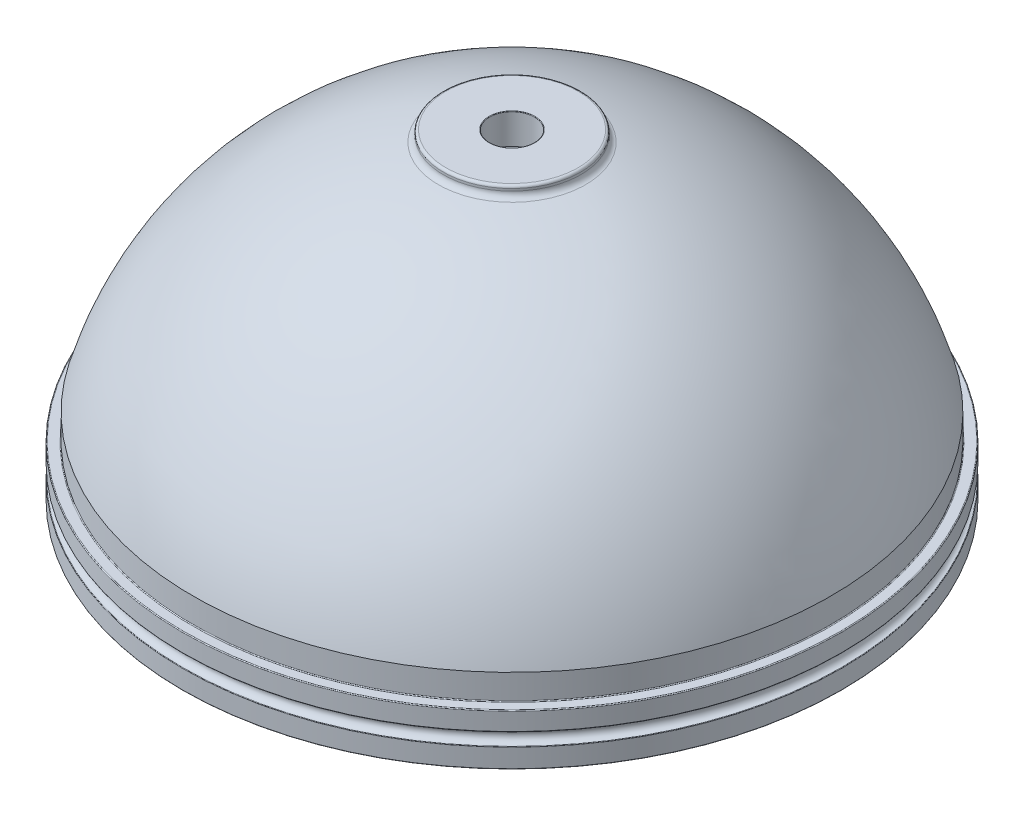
ISO-10303-21;
HEADER;
FILE_DESCRIPTION(('STEP AP214'),'2;1');
FILE_NAME('part.step','',(''),(''),'','','');
FILE_SCHEMA(('AUTOMOTIVE_DESIGN { 1 0 10303 214 1 1 1 1 }'));
ENDSEC;
DATA;
#1=APPLICATION_CONTEXT('core data for automotive mechanical design processes');
#2=APPLICATION_PROTOCOL_DEFINITION('international standard','automotive_design',2000,#1);
#3=PRODUCT_CONTEXT('',#1,'mechanical');
#4=PRODUCT('Part','Part','',(#3));
#5=PRODUCT_RELATED_PRODUCT_CATEGORY('part','',(#4));
#6=PRODUCT_DEFINITION_FORMATION('','',#4);
#7=PRODUCT_DEFINITION_CONTEXT('part definition',#1,'design');
#8=PRODUCT_DEFINITION('design','',#6,#7);
#9=PRODUCT_DEFINITION_SHAPE('','',#8);
#10=(LENGTH_UNIT() NAMED_UNIT(*) SI_UNIT(.MILLI.,.METRE.));
#11=(NAMED_UNIT(*) PLANE_ANGLE_UNIT() SI_UNIT($,.RADIAN.));
#12=(NAMED_UNIT(*) SI_UNIT($,.STERADIAN.) SOLID_ANGLE_UNIT());
#13=UNCERTAINTY_MEASURE_WITH_UNIT(LENGTH_MEASURE(1.E-05),#10,'distance_accuracy_value','');
#14=(GEOMETRIC_REPRESENTATION_CONTEXT(3) GLOBAL_UNCERTAINTY_ASSIGNED_CONTEXT((#13)) GLOBAL_UNIT_ASSIGNED_CONTEXT((#10,
#11,#12)) REPRESENTATION_CONTEXT('',''));
#15=CARTESIAN_POINT('',(0.,0.,0.));
#16=DIRECTION('',(0.,0.,1.));
#17=DIRECTION('',(1.,0.,0.));
#18=AXIS2_PLACEMENT_3D('',#15,#16,#17);
#19=CARTESIAN_POINT('',(0.,0.,0.));
#20=DIRECTION('',(0.,-1.,0.));
#21=DIRECTION('',(0.,0.,-1.));
#22=AXIS2_PLACEMENT_3D('',#19,#20,#21);
#23=CONICAL_SURFACE('',#22,72.0598,0.522328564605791);
#24=CARTESIAN_POINT('',(0.,0.,0.));
#25=DIRECTION('',(0.,-1.,0.));
#26=DIRECTION('',(0.,0.,-1.));
#27=AXIS2_PLACEMENT_3D('',#24,#25,#26);
#28=CIRCLE('',#27,72.0598);
#29=CARTESIAN_POINT('',(0.,0.,-72.0598));
#30=VERTEX_POINT('',#29);
#31=EDGE_CURVE('E259',#30,#30,#28,.T.);
#32=ORIENTED_EDGE('',*,*,#31,.T.);
#33=EDGE_LOOP('',(#32));
#34=FACE_BOUND('',#33,.T.);
#35=CARTESIAN_POINT('',(47.1878148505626,3.86100000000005,-51.4834198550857));
#36=CARTESIAN_POINT('',(47.2379953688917,3.76783129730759,-51.5101794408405));
#37=CARTESIAN_POINT('',(47.289228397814,3.67490203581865,-51.5357775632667));
#38=CARTESIAN_POINT('',(47.3938690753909,3.48960175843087,-51.5845123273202));
#39=CARTESIAN_POINT('',(47.4472771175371,3.39723084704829,-51.6076485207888));
#40=CARTESIAN_POINT('',(47.6112207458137,3.12048317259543,-51.6732946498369));
#41=CARTESIAN_POINT('',(47.7251264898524,2.93712310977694,-51.7118532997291));
#42=CARTESIAN_POINT('',(47.9634702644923,2.57282568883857,-51.7770926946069));
#43=CARTESIAN_POINT('',(48.0879916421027,2.39192350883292,-51.8036666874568));
#44=CARTESIAN_POINT('',(48.3473365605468,2.0362812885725,-51.8420044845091));
#45=CARTESIAN_POINT('',(48.4821424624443,1.86153141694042,-51.8537930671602));
#46=CARTESIAN_POINT('',(48.6777874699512,1.62444033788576,-51.857442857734));
#47=CARTESIAN_POINT('',(48.7338617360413,1.55824635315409,-51.8570560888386));
#48=CARTESIAN_POINT('',(48.8478194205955,1.42753796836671,-51.8531464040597));
#49=CARTESIAN_POINT('',(48.905702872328,1.36302359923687,-51.8496234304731));
#50=CARTESIAN_POINT('',(49.0822082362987,1.17240125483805,-51.833861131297));
#51=CARTESIAN_POINT('',(49.2036904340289,1.04920757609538,-51.8164285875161));
#52=CARTESIAN_POINT('',(49.3923215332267,0.872607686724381,-51.7771572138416));
#53=CARTESIAN_POINT('',(49.4566856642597,0.814773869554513,-51.7617424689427));
#54=CARTESIAN_POINT('',(49.5872683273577,0.702884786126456,-51.7259222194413));
#55=CARTESIAN_POINT('',(49.6534872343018,0.648830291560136,-51.7055156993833));
#56=CARTESIAN_POINT('',(49.8543738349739,0.493959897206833,-51.6359649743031));
#57=CARTESIAN_POINT('',(49.9918343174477,0.399896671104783,-51.5783840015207));
#58=CARTESIAN_POINT('',(50.2127205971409,0.273271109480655,-51.4651183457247));
#59=CARTESIAN_POINT('',(50.2952862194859,0.231280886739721,-51.4182638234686));
#60=CARTESIAN_POINT('',(50.4596544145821,0.160123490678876,-51.3144339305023));
#61=CARTESIAN_POINT('',(50.5414576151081,0.130944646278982,-51.2574678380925));
#62=CARTESIAN_POINT('',(50.7024405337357,0.087774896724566,-51.1332374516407));
#63=CARTESIAN_POINT('',(50.7815925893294,0.0739130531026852,-51.0658910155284));
#64=CARTESIAN_POINT('',(50.9334195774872,0.063364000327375,-50.9230478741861));
#65=CARTESIAN_POINT('',(51.0060973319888,0.0666692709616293,-50.8475547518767));
#66=CARTESIAN_POINT('',(51.1353185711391,0.0888098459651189,-50.6994795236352));
#67=CARTESIAN_POINT('',(51.1927541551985,0.105990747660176,-50.6274139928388));
#68=CARTESIAN_POINT('',(51.2995241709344,0.152327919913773,-50.4812009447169));
#69=CARTESIAN_POINT('',(51.3488540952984,0.181490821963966,-50.4070522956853));
#70=CARTESIAN_POINT('',(51.4582214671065,0.264155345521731,-50.2273681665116));
#71=CARTESIAN_POINT('',(51.5141189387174,0.322735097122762,-50.1216651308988));
#72=CARTESIAN_POINT('',(51.6110150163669,0.454683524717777,-49.9126852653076));
#73=CARTESIAN_POINT('',(51.6519780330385,0.528086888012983,-49.8094147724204));
#74=CARTESIAN_POINT('',(51.7143538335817,0.669921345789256,-49.6267677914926));
#75=CARTESIAN_POINT('',(51.7380261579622,0.73649802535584,-49.5466816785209));
#76=CARTESIAN_POINT('',(51.7782491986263,0.874918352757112,-49.3892701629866));
#77=CARTESIAN_POINT('',(51.7947953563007,0.946765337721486,-49.3119465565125));
#78=CARTESIAN_POINT('',(51.8217181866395,1.0946430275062,-49.1600448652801));
#79=CARTESIAN_POINT('',(51.832083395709,1.17068122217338,-49.0854721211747));
#80=CARTESIAN_POINT('',(51.84738867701,1.32597891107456,-48.939157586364));
#81=CARTESIAN_POINT('',(51.8523267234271,1.40523959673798,-48.8674168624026));
#82=CARTESIAN_POINT('',(51.8595886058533,1.63411125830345,-48.6674490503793));
#83=CARTESIAN_POINT('',(51.8562137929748,1.78678391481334,-48.5425019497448));
#84=CARTESIAN_POINT('',(51.83637952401,2.09803417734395,-48.3012354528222));
#85=CARTESIAN_POINT('',(51.8199082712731,2.25661698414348,-48.1849239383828));
#86=CARTESIAN_POINT('',(51.7759866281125,2.57795034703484,-47.9603254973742));
#87=CARTESIAN_POINT('',(51.7485313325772,2.74070273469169,-47.8520421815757));
#88=CARTESIAN_POINT('',(51.6841845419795,3.06905620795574,-47.6430925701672));
#89=CARTESIAN_POINT('',(51.647297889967,3.23465579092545,-47.5424223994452));
#90=CARTESIAN_POINT('',(51.5874400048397,3.47761487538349,-47.4008805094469));
#91=CARTESIAN_POINT('',(51.5677607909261,3.55415958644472,-47.3571679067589));
#92=CARTESIAN_POINT('',(51.5267886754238,3.70741581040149,-47.2713385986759));
#93=CARTESIAN_POINT('',(51.5055004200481,3.78412626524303,-47.2292177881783));
#94=CARTESIAN_POINT('',(51.4834198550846,3.86100000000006,-47.1878148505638));
#95=B_SPLINE_CURVE_WITH_KNOTS('',3,(#35,#36,#37,#38,#39,#40,#41,#42,#43,#44,#45,#46,#47,#48,#49,
#50,#51,#52,#53,#54,#55,#56,#57,#58,#59,#60,#61,#62,#63,#64,#65,#66,#67,#68,#69,#70,#71,#72,#73,
#74,#75,#76,#77,#78,#79,#80,#81,#82,#83,#84,#85,#86,#87,#88,#89,#90,#91,#92,#93,#94),
.UNSPECIFIED.,.F.,.F.,(4,2,2,2,2,2,2,2,2,2,2,2,2,2,2,2,2,2,2,2,2,2,2,2,2,2,2,2,2,4),(0.,
0.327436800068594,0.654933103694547,1.31221108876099,1.97523336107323,2.6371430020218,
2.89732083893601,3.15750346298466,3.67784375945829,3.94129930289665,4.20480848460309,
4.72948727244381,5.03987977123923,5.34998891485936,5.66269158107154,5.97525727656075,
6.25524812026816,6.53539413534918,6.93260997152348,7.33076629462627,7.65073166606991,
7.97090141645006,8.29166314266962,8.61254456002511,9.20350790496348,9.79500416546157,
10.3867648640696,10.9782222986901,11.2491505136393,11.5193242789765),.UNSPECIFIED.);
#96=CARTESIAN_POINT('',(47.1879225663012,3.8608,-51.4834773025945));
#97=VERTEX_POINT('',#96);
#98=CARTESIAN_POINT('',(51.4834773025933,3.86079999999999,-47.1879225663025));
#99=VERTEX_POINT('',#98);
#100=EDGE_CURVE('E107',#97,#99,#95,.T.);
#101=ORIENTED_EDGE('',*,*,#100,.F.);
#102=CARTESIAN_POINT('',(0.,3.86079999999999,0.));
#103=DIRECTION('',(0.,-1.,0.));
#104=DIRECTION('',(0.,0.,-1.));
#105=AXIS2_PLACEMENT_3D('',#102,#103,#104);
#106=CIRCLE('',#105,69.8373);
#107=CARTESIAN_POINT('',(3.0374158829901,3.86079999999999,-69.7712159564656));
#108=VERTEX_POINT('',#107);
#109=EDGE_CURVE('E11',#108,#97,#106,.T.);
#110=ORIENTED_EDGE('',*,*,#109,.F.);
#111=CARTESIAN_POINT('',(-3.03745142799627,3.861,-69.7710991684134));
#112=CARTESIAN_POINT('',(-3.02089032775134,3.76783129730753,-69.8255040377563));
#113=CARTESIAN_POINT('',(-3.00276371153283,3.67490203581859,-69.8798318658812));
#114=CARTESIAN_POINT('',(-2.96323226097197,3.48960175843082,-69.9882846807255));
#115=CARTESIAN_POINT('',(-2.941826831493,3.39723084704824,-70.0424096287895));
#116=CARTESIAN_POINT('',(-2.87232000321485,3.12048317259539,-70.2047541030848));
#117=CARTESIAN_POINT('',(-2.81904156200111,2.93712310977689,-70.3125627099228));
#118=CARTESIAN_POINT('',(-2.69663828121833,2.57282568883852,-70.5272284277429));
#119=CARTESIAN_POINT('',(-2.62737902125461,2.39192350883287,-70.6340689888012));
#120=CARTESIAN_POINT('',(-2.47110338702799,2.03628128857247,-70.8445624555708));
#121=CARTESIAN_POINT('',(-2.38411700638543,1.86153141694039,-70.9482204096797));
#122=CARTESIAN_POINT('',(-2.24835588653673,1.62444033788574,-71.0891431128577));
#123=CARTESIAN_POINT('',(-2.20843190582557,1.55824635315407,-71.1285201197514));
#124=CARTESIAN_POINT('',(-2.1250870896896,1.42753796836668,-71.2063358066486));
#125=CARTESIAN_POINT('',(-2.08166618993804,1.36302359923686,-71.244774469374));
#126=CARTESIAN_POINT('',(-1.94571242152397,1.17240125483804,-71.358436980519));
#127=CARTESIAN_POINT('',(-1.84748486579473,1.04920757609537,-71.4320111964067));
#128=CARTESIAN_POINT('',(-1.68633348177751,0.872607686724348,-71.5376244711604));
#129=CARTESIAN_POINT('',(-1.62992129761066,0.814773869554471,-71.5722369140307));
#130=CARTESIAN_POINT('',(-1.5122566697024,0.702884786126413,-71.6392440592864));
#131=CARTESIAN_POINT('',(-1.45100324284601,0.648830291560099,-71.6716383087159));
#132=CARTESIAN_POINT('',(-1.25977517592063,0.493959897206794,-71.76450679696));
#133=CARTESIAN_POINT('',(-1.12186004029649,0.399896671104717,-71.8209901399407));
#134=CARTESIAN_POINT('',(-0.885578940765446,0.273271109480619,-71.8970894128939));
#135=CARTESIAN_POINT('',(-0.794065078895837,0.231280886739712,-71.9223409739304));
#136=CARTESIAN_POINT('',(-0.604420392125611,0.160123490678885,-71.965148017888));
#137=CARTESIAN_POINT('',(-0.506295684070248,0.130944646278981,-71.982710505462));
#138=CARTESIAN_POINT('',(-0.304619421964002,0.0877748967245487,-72.0086984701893));
#139=CARTESIAN_POINT('',(-0.201029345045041,0.0739130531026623,-72.0170463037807));
#140=CARTESIAN_POINT('',(0.00733390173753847,0.0633640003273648,-72.0233988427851));
#141=CARTESIAN_POINT('',(0.112106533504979,0.0666692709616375,-72.0214080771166));
#142=CARTESIAN_POINT('',(0.308184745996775,0.0888098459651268,-72.0080762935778));
#143=CARTESIAN_POINT('',(0.399755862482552,0.10599074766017,-71.9977313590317));
#144=CARTESIAN_POINT('',(0.578641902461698,0.152327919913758,-71.969840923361));
#145=CARTESIAN_POINT('',(0.665954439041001,0.181490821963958,-71.9522914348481));
#146=CARTESIAN_POINT('',(0.870344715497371,0.264155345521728,-71.9025699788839));
#147=CARTESIAN_POINT('',(0.984613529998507,0.322735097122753,-71.8673521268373));
#148=CARTESIAN_POINT('',(1.20090048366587,0.454683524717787,-71.7880969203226));
#149=CARTESIAN_POINT('',(1.30288897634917,0.528086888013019,-71.7440388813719));
#150=CARTESIAN_POINT('',(1.47614624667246,0.66992134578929,-71.6589943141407));
#151=CARTESIAN_POINT('',(1.54951454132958,0.736498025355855,-71.6191037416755));
#152=CARTESIAN_POINT('',(1.68926327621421,0.874918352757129,-71.5362389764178));
#153=CARTESIAN_POINT('',(1.75563922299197,0.946765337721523,-71.4932628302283));
#154=CARTESIAN_POINT('',(1.88208725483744,1.09464302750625,-71.4048894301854));
#155=CARTESIAN_POINT('',(1.94214745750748,1.17068122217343,-71.3594878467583));
#156=CARTESIAN_POINT('',(2.05642992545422,1.32597891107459,-71.2668503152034));
#157=CARTESIAN_POINT('',(2.11065000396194,1.405239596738,-71.2196136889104));
#158=CARTESIAN_POINT('',(2.25718352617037,1.63411125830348,-71.0833500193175));
#159=CARTESIAN_POINT('',(2.34314811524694,1.78678391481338,-70.9926127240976));
#160=CARTESIAN_POINT('',(2.49972434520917,2.098034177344,-70.8079866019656));
#161=CARTESIAN_POINT('',(2.57032207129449,2.25661698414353,-70.7140950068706));
#162=CARTESIAN_POINT('',(2.69807986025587,2.57795034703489,-70.5242226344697));
#163=CARTESIAN_POINT('',(2.75523390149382,2.74070273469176,-70.4282409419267));
#164=CARTESIAN_POINT('',(2.85748353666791,3.06905620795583,-70.2349912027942));
#165=CARTESIAN_POINT('',(2.9025852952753,3.23465579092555,-70.1377238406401));
#166=CARTESIAN_POINT('',(2.96034460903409,3.47761487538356,-69.9953126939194));
#167=CARTESIAN_POINT('',(2.97733878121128,3.55415958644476,-69.9504879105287));
#168=CARTESIAN_POINT('',(3.00905760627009,3.70741581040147,-69.8608257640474));
#169=CARTESIAN_POINT('',(3.02378844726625,3.78412626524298,-69.8159887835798));
#170=CARTESIAN_POINT('',(3.03745142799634,3.86099999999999,-69.7710991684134));
#171=B_SPLINE_CURVE_WITH_KNOTS('',3,(#111,#112,#113,#114,#115,#116,#117,#118,#119,#120,#121,
#122,#123,#124,#125,#126,#127,#128,#129,#130,#131,#132,#133,#134,#135,#136,#137,#138,#139,#140,
#141,#142,#143,#144,#145,#146,#147,#148,#149,#150,#151,#152,#153,#154,#155,#156,#157,#158,#159,
#160,#161,#162,#163,#164,#165,#166,#167,#168,#169,#170),.UNSPECIFIED.,.F.,.F.,(4,2,2,2,2,2,2,2,
2,2,2,2,2,2,2,2,2,2,2,2,2,2,2,2,2,2,2,2,2,4),(0.,0.327436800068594,0.654933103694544,
1.31221108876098,1.97523336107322,2.63714300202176,2.89732083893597,3.15750346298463,
3.67784375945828,3.94129930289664,4.20480848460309,4.72948727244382,5.03987977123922,
5.34998891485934,5.66269158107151,5.97525727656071,6.25524812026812,6.53539413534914,
6.93260997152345,7.33076629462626,7.65073166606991,7.97090141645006,8.29166314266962,
8.61254456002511,9.20350790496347,9.79500416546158,10.3867648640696,10.9782222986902,
11.2491505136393,11.5193242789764),.UNSPECIFIED.);
#172=CARTESIAN_POINT('',(-3.0374158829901,3.8608,-69.7712159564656));
#173=VERTEX_POINT('',#172);
#174=EDGE_CURVE('E253',#173,#108,#171,.T.);
#175=ORIENTED_EDGE('',*,*,#174,.F.);
#176=CARTESIAN_POINT('',(-47.1879225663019,3.86079999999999,-51.4834773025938));
#177=VERTEX_POINT('',#176);
#178=EDGE_CURVE('E120',#177,#173,#106,.T.);
#179=ORIENTED_EDGE('',*,*,#178,.F.);
#180=CARTESIAN_POINT('',(-51.4834198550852,3.86100000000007,-47.1878148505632));
#181=CARTESIAN_POINT('',(-51.51017944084,3.76783129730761,-47.2379953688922));
#182=CARTESIAN_POINT('',(-51.5357775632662,3.67490203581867,-47.2892283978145));
#183=CARTESIAN_POINT('',(-51.5845123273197,3.48960175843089,-47.3938690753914));
#184=CARTESIAN_POINT('',(-51.6076485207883,3.39723084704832,-47.4472771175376));
#185=CARTESIAN_POINT('',(-51.6732946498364,3.12048317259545,-47.6112207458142));
#186=CARTESIAN_POINT('',(-51.7118532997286,2.93712310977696,-47.7251264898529));
#187=CARTESIAN_POINT('',(-51.7770926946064,2.57282568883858,-47.9634702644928));
#188=CARTESIAN_POINT('',(-51.8036666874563,2.39192350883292,-48.0879916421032));
#189=CARTESIAN_POINT('',(-51.8420044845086,2.0362812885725,-48.3473365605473));
#190=CARTESIAN_POINT('',(-51.8537930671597,1.86153141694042,-48.4821424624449));
#191=CARTESIAN_POINT('',(-51.8574428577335,1.62444033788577,-48.6777874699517));
#192=CARTESIAN_POINT('',(-51.857056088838,1.55824635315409,-48.7338617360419));
#193=CARTESIAN_POINT('',(-51.8531464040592,1.42753796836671,-48.847819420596));
#194=CARTESIAN_POINT('',(-51.8496234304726,1.36302359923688,-48.9057028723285));
#195=CARTESIAN_POINT('',(-51.8338611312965,1.17240125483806,-49.0822082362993));
#196=CARTESIAN_POINT('',(-51.8164285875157,1.04920757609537,-49.2036904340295));
#197=CARTESIAN_POINT('',(-51.7771572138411,0.872607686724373,-49.3923215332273));
#198=CARTESIAN_POINT('',(-51.7617424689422,0.814773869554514,-49.4566856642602));
#199=CARTESIAN_POINT('',(-51.7259222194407,0.70288478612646,-49.5872683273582));
#200=CARTESIAN_POINT('',(-51.7055156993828,0.648830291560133,-49.6534872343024));
#201=CARTESIAN_POINT('',(-51.6359649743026,0.493959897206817,-49.8543738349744));
#202=CARTESIAN_POINT('',(-51.5783840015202,0.399896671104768,-49.9918343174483));
#203=CARTESIAN_POINT('',(-51.4651183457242,0.273271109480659,-50.2127205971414));
#204=CARTESIAN_POINT('',(-51.418263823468,0.231280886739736,-50.2952862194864));
#205=CARTESIAN_POINT('',(-51.3144339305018,0.160123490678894,-50.4596544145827));
#206=CARTESIAN_POINT('',(-51.2574678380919,0.130944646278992,-50.5414576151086));
#207=CARTESIAN_POINT('',(-51.1332374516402,0.0877748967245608,-50.7024405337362));
#208=CARTESIAN_POINT('',(-51.0658910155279,0.0739130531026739,-50.78159258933));
#209=CARTESIAN_POINT('',(-50.9230478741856,0.0633640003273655,-50.9334195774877));
#210=CARTESIAN_POINT('',(-50.8475547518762,0.0666692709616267,-51.0060973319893));
#211=CARTESIAN_POINT('',(-50.6994795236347,0.0888098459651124,-51.1353185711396));
#212=CARTESIAN_POINT('',(-50.6274139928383,0.105990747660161,-51.192754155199));
#213=CARTESIAN_POINT('',(-50.4812009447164,0.152327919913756,-51.2995241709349));
#214=CARTESIAN_POINT('',(-50.4070522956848,0.181490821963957,-51.3488540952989));
#215=CARTESIAN_POINT('',(-50.2273681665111,0.264155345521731,-51.458221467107));
#216=CARTESIAN_POINT('',(-50.1216651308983,0.322735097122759,-51.514118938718));
#217=CARTESIAN_POINT('',(-49.912685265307,0.454683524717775,-51.6110150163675));
#218=CARTESIAN_POINT('',(-49.8094147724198,0.528086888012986,-51.651978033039));
#219=CARTESIAN_POINT('',(-49.6267677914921,0.669921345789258,-51.7143538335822));
#220=CARTESIAN_POINT('',(-49.5466816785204,0.736498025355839,-51.7380261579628));
#221=CARTESIAN_POINT('',(-49.3892701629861,0.874918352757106,-51.7782491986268));
#222=CARTESIAN_POINT('',(-49.311946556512,0.94676533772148,-51.7947953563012));
#223=CARTESIAN_POINT('',(-49.1600448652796,1.09464302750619,-51.82171818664));
#224=CARTESIAN_POINT('',(-49.0854721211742,1.17068122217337,-51.8320833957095));
#225=CARTESIAN_POINT('',(-48.9391575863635,1.32597891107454,-51.8473886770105));
#226=CARTESIAN_POINT('',(-48.8674168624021,1.40523959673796,-51.8523267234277));
#227=CARTESIAN_POINT('',(-48.6674490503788,1.63411125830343,-51.8595886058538));
#228=CARTESIAN_POINT('',(-48.5425019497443,1.78678391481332,-51.8562137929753));
#229=CARTESIAN_POINT('',(-48.3012354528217,2.09803417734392,-51.8363795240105));
#230=CARTESIAN_POINT('',(-48.1849239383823,2.25661698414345,-51.8199082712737));
#231=CARTESIAN_POINT('',(-47.9603254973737,2.5779503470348,-51.775986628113));
#232=CARTESIAN_POINT('',(-47.8520421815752,2.74070273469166,-51.7485313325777));
#233=CARTESIAN_POINT('',(-47.6430925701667,3.06905620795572,-51.68418454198));
#234=CARTESIAN_POINT('',(-47.5424223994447,3.23465579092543,-51.6472978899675));
#235=CARTESIAN_POINT('',(-47.4008805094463,3.47761487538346,-51.5874400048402));
#236=CARTESIAN_POINT('',(-47.3571679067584,3.5541595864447,-51.5677607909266));
#237=CARTESIAN_POINT('',(-47.2713385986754,3.70741581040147,-51.5267886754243));
#238=CARTESIAN_POINT('',(-47.2292177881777,3.78412626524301,-51.5055004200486));
#239=CARTESIAN_POINT('',(-47.1878148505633,3.86100000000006,-51.4834198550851));
#240=B_SPLINE_CURVE_WITH_KNOTS('',3,(#180,#181,#182,#183,#184,#185,#186,#187,#188,#189,#190,
#191,#192,#193,#194,#195,#196,#197,#198,#199,#200,#201,#202,#203,#204,#205,#206,#207,#208,#209,
#210,#211,#212,#213,#214,#215,#216,#217,#218,#219,#220,#221,#222,#223,#224,#225,#226,#227,#228,
#229,#230,#231,#232,#233,#234,#235,#236,#237,#238,#239),.UNSPECIFIED.,.F.,.F.,(4,2,2,2,2,2,2,2,
2,2,2,2,2,2,2,2,2,2,2,2,2,2,2,2,2,2,2,2,2,4),(0.,0.327436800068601,0.65493310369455,
1.312211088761,1.97523336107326,2.63714300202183,2.89732083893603,3.15750346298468,
3.67784375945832,3.94129930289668,4.20480848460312,4.72948727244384,5.03987977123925,
5.34998891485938,5.66269158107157,5.97525727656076,6.25524812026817,6.5353941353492,
6.9326099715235,7.33076629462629,7.65073166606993,7.97090141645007,8.29166314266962,
8.61254456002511,9.20350790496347,9.79500416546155,10.3867648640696,10.9782222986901,
11.2491505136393,11.5193242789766),.UNSPECIFIED.);
#241=CARTESIAN_POINT('',(-51.483477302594,3.8608,-47.1879225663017));
#242=VERTEX_POINT('',#241);
#243=EDGE_CURVE('E230',#242,#177,#240,.T.);
#244=ORIENTED_EDGE('',*,*,#243,.F.);
#245=CARTESIAN_POINT('',(-69.7712159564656,3.86079999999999,-3.03741588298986));
#246=VERTEX_POINT('',#245);
#247=EDGE_CURVE('E128',#246,#242,#106,.T.);
#248=ORIENTED_EDGE('',*,*,#247,.F.);
#249=CARTESIAN_POINT('',(-69.7710991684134,3.86099999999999,3.03745142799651));
#250=CARTESIAN_POINT('',(-69.8255040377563,3.76783129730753,3.02089032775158));
#251=CARTESIAN_POINT('',(-69.8798318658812,3.67490203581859,3.00276371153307));
#252=CARTESIAN_POINT('',(-69.9882846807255,3.48960175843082,2.96323226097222));
#253=CARTESIAN_POINT('',(-70.0424096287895,3.39723084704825,2.94182683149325));
#254=CARTESIAN_POINT('',(-70.2047541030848,3.12048317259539,2.87232000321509));
#255=CARTESIAN_POINT('',(-70.3125627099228,2.9371231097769,2.81904156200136));
#256=CARTESIAN_POINT('',(-70.5272284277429,2.57282568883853,2.69663828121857));
#257=CARTESIAN_POINT('',(-70.6340689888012,2.39192350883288,2.62737902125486));
#258=CARTESIAN_POINT('',(-70.8445624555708,2.03628128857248,2.47110338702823));
#259=CARTESIAN_POINT('',(-70.9482204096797,1.8615314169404,2.38411700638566));
#260=CARTESIAN_POINT('',(-71.0891431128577,1.62444033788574,2.24835588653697));
#261=CARTESIAN_POINT('',(-71.1285201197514,1.55824635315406,2.20843190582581));
#262=CARTESIAN_POINT('',(-71.2063358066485,1.42753796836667,2.12508708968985));
#263=CARTESIAN_POINT('',(-71.244774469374,1.36302359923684,2.08166618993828));
#264=CARTESIAN_POINT('',(-71.358436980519,1.17240125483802,1.94571242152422));
#265=CARTESIAN_POINT('',(-71.4320111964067,1.04920757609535,1.84748486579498));
#266=CARTESIAN_POINT('',(-71.5376244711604,0.872607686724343,1.68633348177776));
#267=CARTESIAN_POINT('',(-71.5722369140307,0.814773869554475,1.62992129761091));
#268=CARTESIAN_POINT('',(-71.6392440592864,0.702884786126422,1.51225666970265));
#269=CARTESIAN_POINT('',(-71.6716383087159,0.648830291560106,1.45100324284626));
#270=CARTESIAN_POINT('',(-71.76450679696,0.493959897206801,1.25977517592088));
#271=CARTESIAN_POINT('',(-71.8209901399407,0.399896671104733,1.12186004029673));
#272=CARTESIAN_POINT('',(-71.8970894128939,0.273271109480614,0.885578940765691));
#273=CARTESIAN_POINT('',(-71.9223409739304,0.231280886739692,0.794065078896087));
#274=CARTESIAN_POINT('',(-71.965148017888,0.160123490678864,0.604420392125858));
#275=CARTESIAN_POINT('',(-71.9827105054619,0.130944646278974,0.50629568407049));
#276=CARTESIAN_POINT('',(-72.0086984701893,0.0877748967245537,0.304619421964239));
#277=CARTESIAN_POINT('',(-72.0170463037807,0.0739130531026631,0.201029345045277));
#278=CARTESIAN_POINT('',(-72.0233988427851,0.0633640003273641,-0.00733390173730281));
#279=CARTESIAN_POINT('',(-72.0214080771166,0.0666692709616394,-0.112106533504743));
#280=CARTESIAN_POINT('',(-72.0080762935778,0.0888098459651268,-0.308184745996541));
#281=CARTESIAN_POINT('',(-71.9977313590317,0.105990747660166,-0.39975586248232));
#282=CARTESIAN_POINT('',(-71.969840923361,0.152327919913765,-0.578641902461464));
#283=CARTESIAN_POINT('',(-71.9522914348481,0.181490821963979,-0.665954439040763));
#284=CARTESIAN_POINT('',(-71.9025699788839,0.264155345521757,-0.870344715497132));
#285=CARTESIAN_POINT('',(-71.8673521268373,0.322735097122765,-0.984613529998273));
#286=CARTESIAN_POINT('',(-71.7880969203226,0.454683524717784,-1.20090048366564));
#287=CARTESIAN_POINT('',(-71.7440388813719,0.528086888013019,-1.30288897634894));
#288=CARTESIAN_POINT('',(-71.6589943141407,0.669921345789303,-1.47614624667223));
#289=CARTESIAN_POINT('',(-71.6191037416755,0.736498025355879,-1.54951454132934));
#290=CARTESIAN_POINT('',(-71.5362389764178,0.874918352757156,-1.68926327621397));
#291=CARTESIAN_POINT('',(-71.4932628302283,0.946765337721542,-1.75563922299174));
#292=CARTESIAN_POINT('',(-71.4048894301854,1.09464302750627,-1.88208725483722));
#293=CARTESIAN_POINT('',(-71.3594878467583,1.17068122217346,-1.94214745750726));
#294=CARTESIAN_POINT('',(-71.2668503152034,1.32597891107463,-2.056429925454));
#295=CARTESIAN_POINT('',(-71.2196136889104,1.40523959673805,-2.11065000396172));
#296=CARTESIAN_POINT('',(-71.0833500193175,1.63411125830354,-2.25718352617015));
#297=CARTESIAN_POINT('',(-70.9926127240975,1.78678391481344,-2.34314811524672));
#298=CARTESIAN_POINT('',(-70.8079866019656,2.09803417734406,-2.49972434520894));
#299=CARTESIAN_POINT('',(-70.7140950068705,2.25661698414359,-2.57032207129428));
#300=CARTESIAN_POINT('',(-70.5242226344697,2.57795034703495,-2.69807986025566));
#301=CARTESIAN_POINT('',(-70.4282409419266,2.74070273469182,-2.7552339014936));
#302=CARTESIAN_POINT('',(-70.2349912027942,3.06905620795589,-2.85748353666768));
#303=CARTESIAN_POINT('',(-70.1377238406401,3.2346557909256,-2.90258529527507));
#304=CARTESIAN_POINT('',(-69.9953126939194,3.47761487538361,-2.96034460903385));
#305=CARTESIAN_POINT('',(-69.9504879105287,3.5541595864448,-2.97733878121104));
#306=CARTESIAN_POINT('',(-69.8608257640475,3.70741581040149,-3.00905760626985));
#307=CARTESIAN_POINT('',(-69.8159887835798,3.78412626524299,-3.023788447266));
#308=CARTESIAN_POINT('',(-69.7710991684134,3.86099999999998,-3.0374514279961));
#309=B_SPLINE_CURVE_WITH_KNOTS('',3,(#249,#250,#251,#252,#253,#254,#255,#256,#257,#258,#259,
#260,#261,#262,#263,#264,#265,#266,#267,#268,#269,#270,#271,#272,#273,#274,#275,#276,#277,#278,
#279,#280,#281,#282,#283,#284,#285,#286,#287,#288,#289,#290,#291,#292,#293,#294,#295,#296,#297,
#298,#299,#300,#301,#302,#303,#304,#305,#306,#307,#308),.UNSPECIFIED.,.F.,.F.,(4,2,2,2,2,2,2,2,
2,2,2,2,2,2,2,2,2,2,2,2,2,2,2,2,2,2,2,2,2,4),(0.,0.327436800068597,0.654933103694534,
1.31221108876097,1.9752333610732,2.63714300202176,2.89732083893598,3.15750346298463,
3.67784375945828,3.94129930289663,4.20480848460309,4.72948727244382,5.03987977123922,
5.34998891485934,5.66269158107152,5.97525727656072,6.25524812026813,6.53539413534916,
6.93260997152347,7.33076629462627,7.65073166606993,7.97090141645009,8.29166314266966,
8.61254456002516,9.20350790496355,9.79500416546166,10.3867648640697,10.9782222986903,
11.2491505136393,11.5193242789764),.UNSPECIFIED.);
#310=CARTESIAN_POINT('',(-69.7712159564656,3.8608,3.03741588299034));
#311=VERTEX_POINT('',#310);
#312=EDGE_CURVE('E221',#311,#246,#309,.T.);
#313=ORIENTED_EDGE('',*,*,#312,.F.);
#314=CARTESIAN_POINT('',(-51.4834773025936,3.86079999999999,47.1879225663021));
#315=VERTEX_POINT('',#314);
#316=EDGE_CURVE('E133',#315,#311,#106,.T.);
#317=ORIENTED_EDGE('',*,*,#316,.F.);
#318=CARTESIAN_POINT('',(-47.187814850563,3.86100000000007,51.4834198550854));
#319=CARTESIAN_POINT('',(-47.237995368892,3.76783129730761,51.5101794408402));
#320=CARTESIAN_POINT('',(-47.2892283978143,3.67490203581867,51.5357775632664));
#321=CARTESIAN_POINT('',(-47.3938690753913,3.48960175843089,51.5845123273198));
#322=CARTESIAN_POINT('',(-47.4472771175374,3.39723084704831,51.6076485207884));
#323=CARTESIAN_POINT('',(-47.6112207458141,3.12048317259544,51.6732946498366));
#324=CARTESIAN_POINT('',(-47.7251264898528,2.93712310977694,51.7118532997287));
#325=CARTESIAN_POINT('',(-47.9634702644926,2.57282568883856,51.7770926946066));
#326=CARTESIAN_POINT('',(-48.0879916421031,2.3919235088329,51.8036666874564));
#327=CARTESIAN_POINT('',(-48.3473365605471,2.03628128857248,51.8420044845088));
#328=CARTESIAN_POINT('',(-48.4821424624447,1.86153141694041,51.8537930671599));
#329=CARTESIAN_POINT('',(-48.6777874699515,1.62444033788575,51.8574428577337));
#330=CARTESIAN_POINT('',(-48.7338617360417,1.55824635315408,51.8570560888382));
#331=CARTESIAN_POINT('',(-48.8478194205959,1.42753796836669,51.8531464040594));
#332=CARTESIAN_POINT('',(-48.9057028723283,1.36302359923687,51.8496234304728));
#333=CARTESIAN_POINT('',(-49.0822082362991,1.17240125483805,51.8338611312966));
#334=CARTESIAN_POINT('',(-49.2036904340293,1.04920757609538,51.8164285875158));
#335=CARTESIAN_POINT('',(-49.3923215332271,0.87260768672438,51.7771572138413));
#336=CARTESIAN_POINT('',(-49.45668566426,0.814773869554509,51.7617424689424));
#337=CARTESIAN_POINT('',(-49.587268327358,0.702884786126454,51.7259222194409));
#338=CARTESIAN_POINT('',(-49.6534872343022,0.648830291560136,51.7055156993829));
#339=CARTESIAN_POINT('',(-49.8543738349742,0.49395989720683,51.6359649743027));
#340=CARTESIAN_POINT('',(-49.9918343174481,0.399896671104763,51.5783840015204));
#341=CARTESIAN_POINT('',(-50.2127205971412,0.273271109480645,51.4651183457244));
#342=CARTESIAN_POINT('',(-50.2952862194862,0.231280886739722,51.4182638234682));
#343=CARTESIAN_POINT('',(-50.4596544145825,0.160123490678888,51.314433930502));
#344=CARTESIAN_POINT('',(-50.5414576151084,0.130944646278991,51.2574678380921));
#345=CARTESIAN_POINT('',(-50.702440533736,0.0877748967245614,51.1332374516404));
#346=CARTESIAN_POINT('',(-50.7815925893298,0.07391305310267,51.0658910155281));
#347=CARTESIAN_POINT('',(-50.9334195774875,0.0633640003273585,50.9230478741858));
#348=CARTESIAN_POINT('',(-51.0060973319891,0.0666692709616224,50.8475547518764));
#349=CARTESIAN_POINT('',(-51.1353185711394,0.0888098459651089,50.6994795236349));
#350=CARTESIAN_POINT('',(-51.1927541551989,0.105990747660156,50.6274139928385));
#351=CARTESIAN_POINT('',(-51.2995241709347,0.152327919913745,50.4812009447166));
#352=CARTESIAN_POINT('',(-51.3488540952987,0.181490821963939,50.407052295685));
#353=CARTESIAN_POINT('',(-51.4582214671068,0.264155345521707,50.2273681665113));
#354=CARTESIAN_POINT('',(-51.5141189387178,0.322735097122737,50.1216651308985));
#355=CARTESIAN_POINT('',(-51.6110150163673,0.454683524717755,49.9126852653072));
#356=CARTESIAN_POINT('',(-51.6519780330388,0.528086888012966,49.8094147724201));
#357=CARTESIAN_POINT('',(-51.714353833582,0.669921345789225,49.6267677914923));
#358=CARTESIAN_POINT('',(-51.7380261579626,0.736498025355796,49.5466816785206));
#359=CARTESIAN_POINT('',(-51.7782491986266,0.874918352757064,49.3892701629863));
#360=CARTESIAN_POINT('',(-51.794795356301,0.946765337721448,49.3119465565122));
#361=CARTESIAN_POINT('',(-51.8217181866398,1.09464302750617,49.1600448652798));
#362=CARTESIAN_POINT('',(-51.8320833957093,1.17068122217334,49.0854721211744));
#363=CARTESIAN_POINT('',(-51.8473886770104,1.3259789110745,48.9391575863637));
#364=CARTESIAN_POINT('',(-51.8523267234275,1.40523959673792,48.8674168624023));
#365=CARTESIAN_POINT('',(-51.8595886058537,1.63411125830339,48.667449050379));
#366=CARTESIAN_POINT('',(-51.8562137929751,1.78678391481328,48.5425019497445));
#367=CARTESIAN_POINT('',(-51.8363795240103,2.09803417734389,48.3012354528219));
#368=CARTESIAN_POINT('',(-51.8199082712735,2.25661698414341,48.1849239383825));
#369=CARTESIAN_POINT('',(-51.7759866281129,2.57795034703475,47.9603254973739));
#370=CARTESIAN_POINT('',(-51.7485313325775,2.7407027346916,47.8520421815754));
#371=CARTESIAN_POINT('',(-51.6841845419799,3.06905620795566,47.6430925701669));
#372=CARTESIAN_POINT('',(-51.6472978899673,3.23465579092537,47.5424223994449));
#373=CARTESIAN_POINT('',(-51.5874400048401,3.47761487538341,47.4008805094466));
#374=CARTESIAN_POINT('',(-51.5677607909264,3.55415958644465,47.3571679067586));
#375=CARTESIAN_POINT('',(-51.5267886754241,3.70741581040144,47.2713385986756));
#376=CARTESIAN_POINT('',(-51.5055004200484,3.78412626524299,47.2292177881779));
#377=CARTESIAN_POINT('',(-51.4834198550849,3.86100000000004,47.1878148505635));
#378=B_SPLINE_CURVE_WITH_KNOTS('',3,(#318,#319,#320,#321,#322,#323,#324,#325,#326,#327,#328,
#329,#330,#331,#332,#333,#334,#335,#336,#337,#338,#339,#340,#341,#342,#343,#344,#345,#346,#347,
#348,#349,#350,#351,#352,#353,#354,#355,#356,#357,#358,#359,#360,#361,#362,#363,#364,#365,#366,
#367,#368,#369,#370,#371,#372,#373,#374,#375,#376,#377),.UNSPECIFIED.,.F.,.F.,(4,2,2,2,2,2,2,2,
2,2,2,2,2,2,2,2,2,2,2,2,2,2,2,2,2,2,2,2,2,4),(0.,0.327436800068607,0.654933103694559,
1.31221108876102,1.97523336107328,2.63714300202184,2.89732083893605,3.15750346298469,
3.67784375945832,3.94129930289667,4.20480848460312,4.72948727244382,5.03987977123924,
5.34998891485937,5.66269158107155,5.97525727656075,6.25524812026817,6.53539413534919,
6.93260997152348,7.33076629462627,7.6507316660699,7.97090141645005,8.2916631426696,
8.61254456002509,9.20350790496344,9.79500416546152,10.3867648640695,10.9782222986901,
11.2491505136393,11.5193242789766),.UNSPECIFIED.);
#379=CARTESIAN_POINT('',(-47.1879225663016,3.8608,51.4834773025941));
#380=VERTEX_POINT('',#379);
#381=EDGE_CURVE('E197',#380,#315,#378,.T.);
#382=ORIENTED_EDGE('',*,*,#381,.F.);
#383=CARTESIAN_POINT('',(-3.03741588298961,3.86079999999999,69.7712159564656));
#384=VERTEX_POINT('',#383);
#385=EDGE_CURVE('E135',#384,#380,#106,.T.);
#386=ORIENTED_EDGE('',*,*,#385,.F.);
#387=CARTESIAN_POINT('',(3.03745142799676,3.86099999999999,69.7710991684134));
#388=CARTESIAN_POINT('',(3.02089032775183,3.76783129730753,69.8255040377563));
#389=CARTESIAN_POINT('',(3.00276371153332,3.67490203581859,69.8798318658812));
#390=CARTESIAN_POINT('',(2.96323226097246,3.48960175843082,69.9882846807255));
#391=CARTESIAN_POINT('',(2.94182683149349,3.39723084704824,70.0424096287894));
#392=CARTESIAN_POINT('',(2.87232000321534,3.12048317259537,70.2047541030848));
#393=CARTESIAN_POINT('',(2.8190415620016,2.93712310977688,70.3125627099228));
#394=CARTESIAN_POINT('',(2.69663828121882,2.57282568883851,70.5272284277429));
#395=CARTESIAN_POINT('',(2.6273790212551,2.39192350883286,70.6340689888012));
#396=CARTESIAN_POINT('',(2.47110338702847,2.03628128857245,70.8445624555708));
#397=CARTESIAN_POINT('',(2.3841170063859,1.86153141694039,70.9482204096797));
#398=CARTESIAN_POINT('',(2.24835588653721,1.62444033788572,71.0891431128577));
#399=CARTESIAN_POINT('',(2.20843190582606,1.55824635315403,71.1285201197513));
#400=CARTESIAN_POINT('',(2.12508708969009,1.42753796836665,71.2063358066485));
#401=CARTESIAN_POINT('',(2.08166618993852,1.36302359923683,71.244774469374));
#402=CARTESIAN_POINT('',(1.94571242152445,1.17240125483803,71.358436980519));
#403=CARTESIAN_POINT('',(1.84748486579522,1.04920757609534,71.4320111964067));
#404=CARTESIAN_POINT('',(1.686333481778,0.872607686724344,71.5376244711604));
#405=CARTESIAN_POINT('',(1.62992129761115,0.814773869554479,71.5722369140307));
#406=CARTESIAN_POINT('',(1.5122566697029,0.702884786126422,71.6392440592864));
#407=CARTESIAN_POINT('',(1.45100324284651,0.648830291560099,71.6716383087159));
#408=CARTESIAN_POINT('',(1.25977517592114,0.493959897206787,71.76450679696));
#409=CARTESIAN_POINT('',(1.12186004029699,0.399896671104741,71.8209901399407));
#410=CARTESIAN_POINT('',(0.885578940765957,0.273271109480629,71.8970894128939));
#411=CARTESIAN_POINT('',(0.794065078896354,0.231280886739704,71.9223409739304));
#412=CARTESIAN_POINT('',(0.604420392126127,0.160123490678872,71.965148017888));
#413=CARTESIAN_POINT('',(0.506295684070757,0.130944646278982,71.9827105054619));
#414=CARTESIAN_POINT('',(0.304619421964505,0.0877748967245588,72.0086984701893));
#415=CARTESIAN_POINT('',(0.201029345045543,0.0739130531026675,72.0170463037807));
#416=CARTESIAN_POINT('',(-0.00733390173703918,0.0633640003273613,72.0233988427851));
#417=CARTESIAN_POINT('',(-0.112106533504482,0.0666692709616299,72.0214080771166));
#418=CARTESIAN_POINT('',(-0.308184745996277,0.0888098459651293,72.0080762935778));
#419=CARTESIAN_POINT('',(-0.399755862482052,0.105990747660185,71.9977313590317));
#420=CARTESIAN_POINT('',(-0.578641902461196,0.15232791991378,71.969840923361));
#421=CARTESIAN_POINT('',(-0.6659544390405,0.181490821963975,71.9522914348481));
#422=CARTESIAN_POINT('',(-0.87034471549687,0.264155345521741,71.9025699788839));
#423=CARTESIAN_POINT('',(-0.984613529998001,0.322735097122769,71.8673521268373));
#424=CARTESIAN_POINT('',(-1.20090048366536,0.454683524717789,71.7880969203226));
#425=CARTESIAN_POINT('',(-1.30288897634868,0.528086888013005,71.7440388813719));
#426=CARTESIAN_POINT('',(-1.47614624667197,0.669921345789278,71.6589943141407));
#427=CARTESIAN_POINT('',(-1.54951454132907,0.736498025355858,71.6191037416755));
#428=CARTESIAN_POINT('',(-1.68926327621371,0.874918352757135,71.5362389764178));
#429=CARTESIAN_POINT('',(-1.75563922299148,0.946765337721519,71.4932628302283));
#430=CARTESIAN_POINT('',(-1.88208725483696,1.09464302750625,71.4048894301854));
#431=CARTESIAN_POINT('',(-1.94214745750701,1.17068122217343,71.3594878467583));
#432=CARTESIAN_POINT('',(-2.05642992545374,1.32597891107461,71.2668503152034));
#433=CARTESIAN_POINT('',(-2.11065000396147,1.40523959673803,71.2196136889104));
#434=CARTESIAN_POINT('',(-2.25718352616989,1.63411125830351,71.0833500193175));
#435=CARTESIAN_POINT('',(-2.34314811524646,1.78678391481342,70.9926127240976));
#436=CARTESIAN_POINT('',(-2.49972434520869,2.09803417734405,70.8079866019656));
#437=CARTESIAN_POINT('',(-2.57032207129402,2.25661698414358,70.7140950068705));
#438=CARTESIAN_POINT('',(-2.69807986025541,2.57795034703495,70.5242226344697));
#439=CARTESIAN_POINT('',(-2.75523390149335,2.74070273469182,70.4282409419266));
#440=CARTESIAN_POINT('',(-2.85748353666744,3.0690562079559,70.2349912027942));
#441=CARTESIAN_POINT('',(-2.90258529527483,3.23465579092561,70.1377238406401));
#442=CARTESIAN_POINT('',(-2.96034460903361,3.47761487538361,69.9953126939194));
#443=CARTESIAN_POINT('',(-2.9773387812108,3.5541595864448,69.9504879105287));
#444=CARTESIAN_POINT('',(-3.00905760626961,3.70741581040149,69.8608257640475));
#445=CARTESIAN_POINT('',(-3.02378844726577,3.78412626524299,69.8159887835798));
#446=CARTESIAN_POINT('',(-3.03745142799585,3.86099999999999,69.7710991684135));
#447=B_SPLINE_CURVE_WITH_KNOTS('',3,(#387,#388,#389,#390,#391,#392,#393,#394,#395,#396,#397,
#398,#399,#400,#401,#402,#403,#404,#405,#406,#407,#408,#409,#410,#411,#412,#413,#414,#415,#416,
#417,#418,#419,#420,#421,#422,#423,#424,#425,#426,#427,#428,#429,#430,#431,#432,#433,#434,#435,
#436,#437,#438,#439,#440,#441,#442,#443,#444,#445,#446),.UNSPECIFIED.,.F.,.F.,(4,2,2,2,2,2,2,2,
2,2,2,2,2,2,2,2,2,2,2,2,2,2,2,2,2,2,2,2,2,4),(0.,0.327436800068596,0.654933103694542,
1.312211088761,1.97523336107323,2.63714300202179,2.89732083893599,3.15750346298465,
3.67784375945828,3.94129930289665,4.20480848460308,4.7294872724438,5.0398797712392,
5.34998891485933,5.66269158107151,5.97525727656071,6.25524812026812,6.53539413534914,
6.93260997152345,7.33076629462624,7.6507316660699,7.97090141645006,8.29166314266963,
8.61254456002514,9.20350790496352,9.79500416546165,10.3867648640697,10.9782222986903,
11.2491505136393,11.5193242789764),.UNSPECIFIED.);
#448=CARTESIAN_POINT('',(3.03741588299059,3.8608,69.7712159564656));
#449=VERTEX_POINT('',#448);
#450=EDGE_CURVE('E165',#449,#384,#447,.T.);
#451=ORIENTED_EDGE('',*,*,#450,.F.);
#452=CARTESIAN_POINT('',(47.1879225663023,3.86079999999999,51.4834773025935));
#453=VERTEX_POINT('',#452);
#454=EDGE_CURVE('E142',#453,#449,#106,.T.);
#455=ORIENTED_EDGE('',*,*,#454,.F.);
#456=CARTESIAN_POINT('',(51.4834198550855,3.86100000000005,47.1878148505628));
#457=CARTESIAN_POINT('',(51.5101794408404,3.76783129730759,47.2379953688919));
#458=CARTESIAN_POINT('',(51.5357775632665,3.67490203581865,47.2892283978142));
#459=CARTESIAN_POINT('',(51.58451232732,3.48960175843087,47.3938690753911));
#460=CARTESIAN_POINT('',(51.6076485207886,3.39723084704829,47.4472771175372));
#461=CARTESIAN_POINT('',(51.6732946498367,3.12048317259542,47.6112207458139));
#462=CARTESIAN_POINT('',(51.7118532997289,2.93712310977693,47.7251264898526));
#463=CARTESIAN_POINT('',(51.7770926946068,2.57282568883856,47.9634702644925));
#464=CARTESIAN_POINT('',(51.8036666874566,2.3919235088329,48.0879916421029));
#465=CARTESIAN_POINT('',(51.8420044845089,2.03628128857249,48.347336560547));
#466=CARTESIAN_POINT('',(51.85379306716,1.86153141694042,48.4821424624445));
#467=CARTESIAN_POINT('',(51.8574428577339,1.62444033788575,48.6777874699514));
#468=CARTESIAN_POINT('',(51.8570560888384,1.55824635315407,48.7338617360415));
#469=CARTESIAN_POINT('',(51.8531464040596,1.42753796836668,48.8478194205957));
#470=CARTESIAN_POINT('',(51.8496234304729,1.36302359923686,48.9057028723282));
#471=CARTESIAN_POINT('',(51.8338611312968,1.17240125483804,49.0822082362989));
#472=CARTESIAN_POINT('',(51.816428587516,1.04920757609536,49.2036904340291));
#473=CARTESIAN_POINT('',(51.7771572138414,0.872607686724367,49.3923215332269));
#474=CARTESIAN_POINT('',(51.7617424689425,0.814773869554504,49.4566856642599));
#475=CARTESIAN_POINT('',(51.7259222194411,0.702884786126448,49.5872683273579));
#476=CARTESIAN_POINT('',(51.7055156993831,0.648830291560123,49.653487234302));
#477=CARTESIAN_POINT('',(51.6359649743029,0.493959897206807,49.8543738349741));
#478=CARTESIAN_POINT('',(51.5783840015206,0.399896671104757,49.9918343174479));
#479=CARTESIAN_POINT('',(51.4651183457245,0.273271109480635,50.2127205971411));
#480=CARTESIAN_POINT('',(51.4182638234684,0.231280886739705,50.2952862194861));
#481=CARTESIAN_POINT('',(51.3144339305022,0.160123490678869,50.4596544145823));
#482=CARTESIAN_POINT('',(51.2574678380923,0.130944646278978,50.5414576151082));
#483=CARTESIAN_POINT('',(51.1332374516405,0.0877748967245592,50.7024405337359));
#484=CARTESIAN_POINT('',(51.0658910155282,0.0739130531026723,50.7815925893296));
#485=CARTESIAN_POINT('',(50.923047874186,0.0633640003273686,50.9334195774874));
#486=CARTESIAN_POINT('',(50.8475547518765,0.0666692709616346,51.006097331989));
#487=CARTESIAN_POINT('',(50.699479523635,0.0888098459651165,51.1353185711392));
#488=CARTESIAN_POINT('',(50.6274139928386,0.105990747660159,51.1927541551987));
#489=CARTESIAN_POINT('',(50.4812009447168,0.152327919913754,51.2995241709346));
#490=CARTESIAN_POINT('',(50.4070522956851,0.18149082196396,51.3488540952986));
#491=CARTESIAN_POINT('',(50.2273681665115,0.264155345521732,51.4582214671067));
#492=CARTESIAN_POINT('',(50.1216651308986,0.322735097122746,51.5141189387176));
#493=CARTESIAN_POINT('',(49.9126852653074,0.45468352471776,51.6110150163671));
#494=CARTESIAN_POINT('',(49.8094147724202,0.528086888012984,51.6519780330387));
#495=CARTESIAN_POINT('',(49.6267677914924,0.669921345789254,51.7143538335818));
#496=CARTESIAN_POINT('',(49.5466816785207,0.736498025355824,51.7380261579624));
#497=CARTESIAN_POINT('',(49.3892701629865,0.874918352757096,51.7782491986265));
#498=CARTESIAN_POINT('',(49.3119465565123,0.946765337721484,51.7947953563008));
#499=CARTESIAN_POINT('',(49.1600448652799,1.0946430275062,51.8217181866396));
#500=CARTESIAN_POINT('',(49.0854721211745,1.17068122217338,51.8320833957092));
#501=CARTESIAN_POINT('',(48.9391575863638,1.32597891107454,51.8473886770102));
#502=CARTESIAN_POINT('',(48.8674168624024,1.40523959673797,51.8523267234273));
#503=CARTESIAN_POINT('',(48.6674490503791,1.63411125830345,51.8595886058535));
#504=CARTESIAN_POINT('',(48.5425019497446,1.78678391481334,51.8562137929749));
#505=CARTESIAN_POINT('',(48.301235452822,2.09803417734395,51.8363795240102));
#506=CARTESIAN_POINT('',(48.1849239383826,2.25661698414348,51.8199082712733));
#507=CARTESIAN_POINT('',(47.960325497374,2.57795034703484,51.7759866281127));
#508=CARTESIAN_POINT('',(47.8520421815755,2.74070273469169,51.7485313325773));
#509=CARTESIAN_POINT('',(47.643092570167,3.06905620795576,51.6841845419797));
#510=CARTESIAN_POINT('',(47.542422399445,3.23465579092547,51.6472978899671));
#511=CARTESIAN_POINT('',(47.4008805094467,3.4776148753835,51.5874400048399));
#512=CARTESIAN_POINT('',(47.3571679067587,3.55415958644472,51.5677607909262));
#513=CARTESIAN_POINT('',(47.2713385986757,3.70741581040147,51.526788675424));
#514=CARTESIAN_POINT('',(47.2292177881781,3.784126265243,51.5055004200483));
#515=CARTESIAN_POINT('',(47.1878148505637,3.86100000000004,51.4834198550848));
#516=B_SPLINE_CURVE_WITH_KNOTS('',3,(#456,#457,#458,#459,#460,#461,#462,#463,#464,#465,#466,
#467,#468,#469,#470,#471,#472,#473,#474,#475,#476,#477,#478,#479,#480,#481,#482,#483,#484,#485,
#486,#487,#488,#489,#490,#491,#492,#493,#494,#495,#496,#497,#498,#499,#500,#501,#502,#503,#504,
#505,#506,#507,#508,#509,#510,#511,#512,#513,#514,#515),.UNSPECIFIED.,.F.,.F.,(4,2,2,2,2,2,2,2,
2,2,2,2,2,2,2,2,2,2,2,2,2,2,2,2,2,2,2,2,2,4),(0.,0.327436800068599,0.654933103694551,
1.312211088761,1.97523336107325,2.63714300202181,2.89732083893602,3.15750346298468,
3.67784375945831,3.94129930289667,4.20480848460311,4.72948727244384,5.03987977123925,
5.34998891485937,5.66269158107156,5.97525727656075,6.25524812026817,6.53539413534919,
6.93260997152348,7.33076629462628,7.65073166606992,7.97090141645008,8.29166314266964,
8.61254456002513,9.2035079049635,9.79500416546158,10.3867648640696,10.9782222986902,
11.2491505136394,11.5193242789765),.UNSPECIFIED.);
#517=CARTESIAN_POINT('',(51.4834773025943,3.8608,47.1879225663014));
#518=VERTEX_POINT('',#517);
#519=EDGE_CURVE('E158',#518,#453,#516,.T.);
#520=ORIENTED_EDGE('',*,*,#519,.F.);
#521=CARTESIAN_POINT('',(69.7712159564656,3.86079999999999,3.03741588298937));
#522=VERTEX_POINT('',#521);
#523=EDGE_CURVE('E103',#522,#518,#106,.T.);
#524=ORIENTED_EDGE('',*,*,#523,.F.);
#525=CARTESIAN_POINT('',(69.7710991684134,3.861,-3.037451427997));
#526=CARTESIAN_POINT('',(69.8255040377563,3.76783129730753,-3.02089032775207));
#527=CARTESIAN_POINT('',(69.8798318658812,3.67490203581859,-3.00276371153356));
#528=CARTESIAN_POINT('',(69.9882846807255,3.48960175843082,-2.96323226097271));
#529=CARTESIAN_POINT('',(70.0424096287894,3.39723084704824,-2.94182683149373));
#530=CARTESIAN_POINT('',(70.2047541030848,3.12048317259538,-2.87232000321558));
#531=CARTESIAN_POINT('',(70.3125627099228,2.93712310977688,-2.81904156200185));
#532=CARTESIAN_POINT('',(70.5272284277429,2.57282568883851,-2.69663828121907));
#533=CARTESIAN_POINT('',(70.6340689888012,2.39192350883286,-2.62737902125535));
#534=CARTESIAN_POINT('',(70.8445624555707,2.03628128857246,-2.47110338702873));
#535=CARTESIAN_POINT('',(70.9482204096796,1.86153141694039,-2.38411700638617));
#536=CARTESIAN_POINT('',(71.0891431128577,1.62444033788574,-2.24835588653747));
#537=CARTESIAN_POINT('',(71.1285201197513,1.55824635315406,-2.20843190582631));
#538=CARTESIAN_POINT('',(71.2063358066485,1.42753796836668,-2.12508708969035));
#539=CARTESIAN_POINT('',(71.244774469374,1.36302359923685,-2.08166618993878));
#540=CARTESIAN_POINT('',(71.358436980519,1.17240125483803,-1.94571242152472));
#541=CARTESIAN_POINT('',(71.4320111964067,1.04920757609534,-1.8474848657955));
#542=CARTESIAN_POINT('',(71.5376244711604,0.872607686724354,-1.68633348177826));
#543=CARTESIAN_POINT('',(71.5722369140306,0.814773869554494,-1.62992129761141));
#544=CARTESIAN_POINT('',(71.6392440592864,0.70288478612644,-1.51225666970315));
#545=CARTESIAN_POINT('',(71.6716383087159,0.648830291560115,-1.45100324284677));
#546=CARTESIAN_POINT('',(71.76450679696,0.493959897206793,-1.2597751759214));
#547=CARTESIAN_POINT('',(71.8209901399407,0.399896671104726,-1.12186004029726));
#548=CARTESIAN_POINT('',(71.8970894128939,0.273271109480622,-0.885578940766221));
#549=CARTESIAN_POINT('',(71.9223409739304,0.231280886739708,-0.794065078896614));
#550=CARTESIAN_POINT('',(71.965148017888,0.160123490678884,-0.604420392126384));
#551=CARTESIAN_POINT('',(71.9827105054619,0.130944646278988,-0.506295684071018));
#552=CARTESIAN_POINT('',(72.0086984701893,0.087774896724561,-0.304619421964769));
#553=CARTESIAN_POINT('',(72.0170463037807,0.0739130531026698,-0.201029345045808));
#554=CARTESIAN_POINT('',(72.0233988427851,0.0633640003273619,0.00733390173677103));
#555=CARTESIAN_POINT('',(72.0214080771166,0.0666692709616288,0.112106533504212));
#556=CARTESIAN_POINT('',(72.0080762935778,0.0888098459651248,0.308184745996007));
#557=CARTESIAN_POINT('',(71.9977313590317,0.105990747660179,0.399755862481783));
#558=CARTESIAN_POINT('',(71.969840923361,0.152327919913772,0.578641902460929));
#559=CARTESIAN_POINT('',(71.9522914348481,0.181490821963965,0.665954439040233));
#560=CARTESIAN_POINT('',(71.9025699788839,0.264155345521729,0.870344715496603));
#561=CARTESIAN_POINT('',(71.8673521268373,0.322735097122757,0.984613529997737));
#562=CARTESIAN_POINT('',(71.7880969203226,0.454683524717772,1.2009004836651));
#563=CARTESIAN_POINT('',(71.744038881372,0.528086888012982,1.30288897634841));
#564=CARTESIAN_POINT('',(71.6589943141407,0.669921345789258,1.4761462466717));
#565=CARTESIAN_POINT('',(71.6191037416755,0.736498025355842,1.5495145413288));
#566=CARTESIAN_POINT('',(71.5362389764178,0.874918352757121,1.68926327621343));
#567=CARTESIAN_POINT('',(71.4932628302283,0.946765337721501,1.7556392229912));
#568=CARTESIAN_POINT('',(71.4048894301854,1.09464302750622,1.88208725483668));
#569=CARTESIAN_POINT('',(71.3594878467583,1.17068122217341,1.94214745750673));
#570=CARTESIAN_POINT('',(71.2668503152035,1.32597891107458,2.05642992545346));
#571=CARTESIAN_POINT('',(71.2196136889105,1.40523959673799,2.11065000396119));
#572=CARTESIAN_POINT('',(71.0833500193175,1.63411125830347,2.25718352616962));
#573=CARTESIAN_POINT('',(70.9926127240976,1.78678391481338,2.34314811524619));
#574=CARTESIAN_POINT('',(70.8079866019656,2.098034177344,2.49972434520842));
#575=CARTESIAN_POINT('',(70.7140950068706,2.25661698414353,2.57032207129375));
#576=CARTESIAN_POINT('',(70.5242226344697,2.5779503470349,2.69807986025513));
#577=CARTESIAN_POINT('',(70.4282409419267,2.74070273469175,2.75523390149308));
#578=CARTESIAN_POINT('',(70.2349912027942,3.06905620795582,2.85748353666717));
#579=CARTESIAN_POINT('',(70.1377238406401,3.23465579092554,2.90258529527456));
#580=CARTESIAN_POINT('',(69.9953126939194,3.47761487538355,2.96034460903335));
#581=CARTESIAN_POINT('',(69.9504879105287,3.55415958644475,2.97733878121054));
#582=CARTESIAN_POINT('',(69.8608257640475,3.70741581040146,3.00905760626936));
#583=CARTESIAN_POINT('',(69.8159887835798,3.78412626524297,3.02378844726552));
#584=CARTESIAN_POINT('',(69.7710991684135,3.86099999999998,3.03745142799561));
#585=B_SPLINE_CURVE_WITH_KNOTS('',3,(#525,#526,#527,#528,#529,#530,#531,#532,#533,#534,#535,
#536,#537,#538,#539,#540,#541,#542,#543,#544,#545,#546,#547,#548,#549,#550,#551,#552,#553,#554,
#555,#556,#557,#558,#559,#560,#561,#562,#563,#564,#565,#566,#567,#568,#569,#570,#571,#572,#573,
#574,#575,#576,#577,#578,#579,#580,#581,#582,#583,#584),.UNSPECIFIED.,.F.,.F.,(4,2,2,2,2,2,2,2,
2,2,2,2,2,2,2,2,2,2,2,2,2,2,2,2,2,2,2,2,2,4),(0.,0.327436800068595,0.654933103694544,
1.31221108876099,1.97523336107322,2.63714300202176,2.89732083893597,3.15750346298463,
3.67784375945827,3.94129930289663,4.20480848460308,4.72948727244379,5.0398797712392,
5.34998891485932,5.6626915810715,5.97525727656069,6.25524812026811,6.53539413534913,
6.93260997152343,7.33076629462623,7.65073166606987,7.97090141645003,8.2916631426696,
8.6125445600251,9.20350790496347,9.79500416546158,10.3867648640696,10.9782222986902,
11.2491505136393,11.5193242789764),.UNSPECIFIED.);
#586=CARTESIAN_POINT('',(69.7712159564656,3.8608,-3.03741588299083));
#587=VERTEX_POINT('',#586);
#588=EDGE_CURVE('E159',#587,#522,#585,.T.);
#589=ORIENTED_EDGE('',*,*,#588,.F.);
#590=EDGE_CURVE('E44',#99,#587,#106,.T.);
#591=ORIENTED_EDGE('',*,*,#590,.F.);
#592=EDGE_LOOP('',(#101,#110,#175,#179,#244,#248,#313,#317,#382,#386,#451,#455,#520,#524,#589,#591));
#593=FACE_BOUND('',#592,.T.);
#594=ADVANCED_FACE('F35',(#34,#593),#23,.F.);
#595=CARTESIAN_POINT('',(0.,0.,0.));
#596=DIRECTION('',(0.,-1.,0.));
#597=DIRECTION('',(0.,0.,-1.));
#598=AXIS2_PLACEMENT_3D('',#595,#596,#597);
#599=CYLINDRICAL_SURFACE('',#598,69.8373);
#600=CARTESIAN_POINT('',(0.,7.87399999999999,0.));
#601=DIRECTION('',(0.,-1.,0.));
#602=DIRECTION('',(0.,0.,-1.));
#603=AXIS2_PLACEMENT_3D('',#600,#601,#602);
#604=CIRCLE('',#603,69.8373);
#605=CARTESIAN_POINT('',(0.,7.87399999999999,-69.8373));
#606=VERTEX_POINT('',#605);
#607=EDGE_CURVE('E123',#606,#606,#604,.T.);
#608=ORIENTED_EDGE('',*,*,#607,.F.);
#609=EDGE_LOOP('',(#608));
#610=FACE_BOUND('',#609,.T.);
#611=ORIENTED_EDGE('',*,*,#109,.T.);
#612=EDGE_CURVE('E43',#97,#99,#106,.T.);
#613=ORIENTED_EDGE('',*,*,#612,.T.);
#614=ORIENTED_EDGE('',*,*,#590,.T.);
#615=EDGE_CURVE('E144',#587,#522,#106,.T.);
#616=ORIENTED_EDGE('',*,*,#615,.T.);
#617=ORIENTED_EDGE('',*,*,#523,.T.);
#618=EDGE_CURVE('E138',#518,#453,#106,.T.);
#619=ORIENTED_EDGE('',*,*,#618,.T.);
#620=ORIENTED_EDGE('',*,*,#454,.T.);
#621=EDGE_CURVE('E137',#449,#384,#106,.T.);
#622=ORIENTED_EDGE('',*,*,#621,.T.);
#623=ORIENTED_EDGE('',*,*,#385,.T.);
#624=EDGE_CURVE('E130',#380,#315,#106,.T.);
#625=ORIENTED_EDGE('',*,*,#624,.T.);
#626=ORIENTED_EDGE('',*,*,#316,.T.);
#627=EDGE_CURVE('E125',#311,#246,#106,.T.);
#628=ORIENTED_EDGE('',*,*,#627,.T.);
#629=ORIENTED_EDGE('',*,*,#247,.T.);
#630=EDGE_CURVE('E124',#242,#177,#106,.T.);
#631=ORIENTED_EDGE('',*,*,#630,.T.);
#632=ORIENTED_EDGE('',*,*,#178,.T.);
#633=EDGE_CURVE('E45',#173,#108,#106,.T.);
#634=ORIENTED_EDGE('',*,*,#633,.T.);
#635=EDGE_LOOP('',(#611,#613,#614,#616,#617,#619,#620,#622,#623,#625,#626,#628,#629,#631,#632,#634));
#636=FACE_BOUND('',#635,.T.);
#637=ADVANCED_FACE('F116',(#610,#636),#599,.F.);
#638=CARTESIAN_POINT('',(-69.8373,7.87399999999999,0.));
#639=DIRECTION('',(0.,-1.,0.));
#640=DIRECTION('',(0.,0.,-1.));
#641=AXIS2_PLACEMENT_3D('',#638,#639,#640);
#642=PLANE('',#641);
#643=CARTESIAN_POINT('',(0.,7.87399999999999,0.));
#644=DIRECTION('',(0.,-1.,0.));
#645=DIRECTION('',(0.,0.,-1.));
#646=AXIS2_PLACEMENT_3D('',#643,#644,#645);
#647=CIRCLE('',#646,71.6026);
#648=CARTESIAN_POINT('',(0.,7.87399999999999,-71.6026));
#649=VERTEX_POINT('',#648);
#650=EDGE_CURVE('E127',#649,#649,#647,.T.);
#651=ORIENTED_EDGE('',*,*,#650,.F.);
#652=EDGE_LOOP('',(#651));
#653=FACE_BOUND('',#652,.T.);
#654=ORIENTED_EDGE('',*,*,#607,.T.);
#655=EDGE_LOOP('',(#654));
#656=FACE_BOUND('',#655,.T.);
#657=ADVANCED_FACE('F387',(#653,#656),#642,.F.);
#658=CARTESIAN_POINT('',(0.,0.,0.));
#659=DIRECTION('',(0.,-1.,0.));
#660=DIRECTION('',(0.,0.,-1.));
#661=AXIS2_PLACEMENT_3D('',#658,#659,#660);
#662=CYLINDRICAL_SURFACE('',#661,71.6026);
#663=CARTESIAN_POINT('',(0.,9.62659999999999,0.));
#664=DIRECTION('',(0.,-1.,0.));
#665=DIRECTION('',(0.,0.,-1.));
#666=AXIS2_PLACEMENT_3D('',#663,#664,#665);
#667=CIRCLE('',#666,71.6026);
#668=CARTESIAN_POINT('',(0.,9.62659999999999,-71.6026));
#669=VERTEX_POINT('',#668);
#670=EDGE_CURVE('E379',#669,#669,#667,.T.);
#671=ORIENTED_EDGE('',*,*,#670,.F.);
#672=EDGE_LOOP('',(#671));
#673=FACE_BOUND('',#672,.T.);
#674=ORIENTED_EDGE('',*,*,#650,.T.);
#675=EDGE_LOOP('',(#674));
#676=FACE_BOUND('',#675,.T.);
#677=ADVANCED_FACE('F385',(#673,#676),#662,.F.);
#678=CARTESIAN_POINT('',(-71.6026,9.62659999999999,0.));
#679=DIRECTION('',(0.,1.,0.));
#680=DIRECTION('',(0.,0.,1.));
#681=AXIS2_PLACEMENT_3D('',#678,#679,#680);
#682=PLANE('',#681);
#683=CARTESIAN_POINT('',(0.,9.62659999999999,0.));
#684=DIRECTION('',(0.,-1.,0.));
#685=DIRECTION('',(0.,0.,-1.));
#686=AXIS2_PLACEMENT_3D('',#683,#684,#685);
#687=CIRCLE('',#686,69.8373);
#688=CARTESIAN_POINT('',(0.,9.62659999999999,-69.8373));
#689=VERTEX_POINT('',#688);
#690=EDGE_CURVE('E376',#689,#689,#687,.T.);
#691=ORIENTED_EDGE('',*,*,#690,.F.);
#692=EDGE_LOOP('',(#691));
#693=FACE_BOUND('',#692,.T.);
#694=ORIENTED_EDGE('',*,*,#670,.T.);
#695=EDGE_LOOP('',(#694));
#696=FACE_BOUND('',#695,.T.);
#697=ADVANCED_FACE('F401',(#693,#696),#682,.F.);
#698=CARTESIAN_POINT('',(0.,0.,0.));
#699=DIRECTION('',(0.,-1.,0.));
#700=DIRECTION('',(0.,0.,-1.));
#701=AXIS2_PLACEMENT_3D('',#698,#699,#700);
#702=CYLINDRICAL_SURFACE('',#701,69.8373);
#703=CARTESIAN_POINT('',(0.,12.8016,0.));
#704=DIRECTION('',(0.,-1.,0.));
#705=DIRECTION('',(0.,0.,-1.));
#706=AXIS2_PLACEMENT_3D('',#703,#704,#705);
#707=CIRCLE('',#706,69.8373);
#708=CARTESIAN_POINT('',(0.,12.8016,-69.8373));
#709=VERTEX_POINT('',#708);
#710=EDGE_CURVE('E373',#709,#709,#707,.T.);
#711=ORIENTED_EDGE('',*,*,#710,.F.);
#712=EDGE_LOOP('',(#711));
#713=FACE_BOUND('',#712,.T.);
#714=ORIENTED_EDGE('',*,*,#690,.T.);
#715=EDGE_LOOP('',(#714));
#716=FACE_BOUND('',#715,.T.);
#717=ADVANCED_FACE('F405',(#713,#716),#702,.F.);
#718=CARTESIAN_POINT('',(0.,12.8016,0.));
#719=DIRECTION('',(0.,1.,0.));
#720=DIRECTION('',(0.,0.,1.));
#721=AXIS2_PLACEMENT_3D('',#718,#719,#720);
#722=CONICAL_SURFACE('',#721,69.8373,0.56522996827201);
#723=CARTESIAN_POINT('',(0.,15.5448,0.));
#724=DIRECTION('',(0.,-1.,0.));
#725=DIRECTION('',(0.,0.,-1.));
#726=AXIS2_PLACEMENT_3D('',#723,#724,#725);
#727=CIRCLE('',#726,71.5772);
#728=CARTESIAN_POINT('',(0.,15.5448,-71.5772));
#729=VERTEX_POINT('',#728);
#730=EDGE_CURVE('E370',#729,#729,#727,.T.);
#731=ORIENTED_EDGE('',*,*,#730,.F.);
#732=EDGE_LOOP('',(#731));
#733=FACE_BOUND('',#732,.T.);
#734=ORIENTED_EDGE('',*,*,#710,.T.);
#735=EDGE_LOOP('',(#734));
#736=FACE_BOUND('',#735,.T.);
#737=ADVANCED_FACE('F409',(#733,#736),#722,.F.);
#738=CARTESIAN_POINT('',(0.,22.3770863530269,0.));
#739=DIRECTION('',(0.,-1.,0.));
#740=DIRECTION('',(0.,0.,-1.));
#741=AXIS2_PLACEMENT_3D('',#738,#739,#740);
#742=TOROIDAL_SURFACE('',#741,60.8716003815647,12.7);
#743=CARTESIAN_POINT('',(0.,26.7462,0.));
#744=DIRECTION('',(0.,-1.,0.));
#745=DIRECTION('',(0.,0.,-1.));
#746=AXIS2_PLACEMENT_3D('',#743,#744,#745);
#747=CIRCLE('',#746,72.7964);
#748=CARTESIAN_POINT('',(0.,26.7462,-72.7964));
#749=VERTEX_POINT('',#748);
#750=EDGE_CURVE('E367',#749,#749,#747,.T.);
#751=ORIENTED_EDGE('',*,*,#750,.F.);
#752=EDGE_LOOP('',(#751));
#753=FACE_BOUND('',#752,.T.);
#754=ORIENTED_EDGE('',*,*,#730,.T.);
#755=EDGE_LOOP('',(#754));
#756=FACE_BOUND('',#755,.T.);
#757=ADVANCED_FACE('F413',(#753,#756),#742,.F.);
#758=CARTESIAN_POINT('',(0.,0.00513983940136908,0.));
#759=DIRECTION('',(0.,-1.,0.));
#760=DIRECTION('',(0.,0.,-1.));
#761=AXIS2_PLACEMENT_3D('',#758,#759,#760);
#762=DEGENERATE_TOROIDAL_SURFACE('',#761,0.00945605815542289,77.56144,.F.);
#763=CARTESIAN_POINT('',(0.,76.0476,0.));
#764=DIRECTION('',(0.,-1.,0.));
#765=DIRECTION('',(0.,0.,-1.));
#766=AXIS2_PLACEMENT_3D('',#763,#764,#765);
#767=CIRCLE('',#766,15.2654);
#768=CARTESIAN_POINT('',(0.,76.0476,-15.2654));
#769=VERTEX_POINT('',#768);
#770=EDGE_CURVE('E364',#769,#769,#767,.T.);
#771=ORIENTED_EDGE('',*,*,#770,.F.);
#772=EDGE_LOOP('',(#771));
#773=FACE_BOUND('',#772,.T.);
#774=ORIENTED_EDGE('',*,*,#750,.T.);
#775=EDGE_LOOP('',(#774));
#776=FACE_BOUND('',#775,.T.);
#777=ADVANCED_FACE('F417',(#773,#776),#762,.T.);
#778=CARTESIAN_POINT('',(0.,72.9316620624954,0.));
#779=DIRECTION('',(0.,-1.,0.));
#780=DIRECTION('',(0.,0.,-1.));
#781=AXIS2_PLACEMENT_3D('',#778,#779,#780);
#782=TOROIDAL_SURFACE('',#781,15.8749537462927,3.175);
#783=CARTESIAN_POINT('',(0.,72.9488,0.));
#784=DIRECTION('',(0.,-1.,0.));
#785=DIRECTION('',(0.,0.,-1.));
#786=AXIS2_PLACEMENT_3D('',#783,#784,#785);
#787=CIRCLE('',#786,12.7);
#788=CARTESIAN_POINT('',(0.,72.9488,-12.7));
#789=VERTEX_POINT('',#788);
#790=EDGE_CURVE('E361',#789,#789,#787,.T.);
#791=ORIENTED_EDGE('',*,*,#790,.F.);
#792=EDGE_LOOP('',(#791));
#793=FACE_BOUND('',#792,.T.);
#794=ORIENTED_EDGE('',*,*,#770,.T.);
#795=EDGE_LOOP('',(#794));
#796=FACE_BOUND('',#795,.T.);
#797=ADVANCED_FACE('F421',(#793,#796),#782,.F.);
#798=CARTESIAN_POINT('',(0.,0.,0.));
#799=DIRECTION('',(0.,-1.,0.));
#800=DIRECTION('',(0.,0.,-1.));
#801=AXIS2_PLACEMENT_3D('',#798,#799,#800);
#802=CYLINDRICAL_SURFACE('',#801,12.7);
#803=CARTESIAN_POINT('',(0.,60.2488,0.));
#804=DIRECTION('',(0.,-1.,0.));
#805=DIRECTION('',(0.,0.,-1.));
#806=AXIS2_PLACEMENT_3D('',#803,#804,#805);
#807=CIRCLE('',#806,12.7);
#808=CARTESIAN_POINT('',(0.,60.2488,-12.7));
#809=VERTEX_POINT('',#808);
#810=EDGE_CURVE('E358',#809,#809,#807,.T.);
#811=ORIENTED_EDGE('',*,*,#810,.F.);
#812=EDGE_LOOP('',(#811));
#813=FACE_BOUND('',#812,.T.);
#814=ORIENTED_EDGE('',*,*,#790,.T.);
#815=EDGE_LOOP('',(#814));
#816=FACE_BOUND('',#815,.T.);
#817=ADVANCED_FACE('F425',(#813,#816),#802,.T.);
#818=CARTESIAN_POINT('',(-8.73125,60.2488,0.));
#819=DIRECTION('',(0.,1.,0.));
#820=DIRECTION('',(0.,0.,1.));
#821=AXIS2_PLACEMENT_3D('',#818,#819,#820);
#822=PLANE('',#821);
#823=CARTESIAN_POINT('',(0.,60.2488,0.));
#824=DIRECTION('',(0.,-1.,0.));
#825=DIRECTION('',(0.,0.,-1.));
#826=AXIS2_PLACEMENT_3D('',#823,#824,#825);
#827=CIRCLE('',#826,8.73125);
#828=CARTESIAN_POINT('',(0.,60.2488,-8.73125));
#829=VERTEX_POINT('',#828);
#830=EDGE_CURVE('E355',#829,#829,#827,.T.);
#831=ORIENTED_EDGE('',*,*,#830,.F.);
#832=EDGE_LOOP('',(#831));
#833=FACE_BOUND('',#832,.T.);
#834=ORIENTED_EDGE('',*,*,#810,.T.);
#835=EDGE_LOOP('',(#834));
#836=FACE_BOUND('',#835,.T.);
#837=ADVANCED_FACE('F429',(#833,#836),#822,.F.);
#838=CARTESIAN_POINT('',(0.,0.,0.));
#839=DIRECTION('',(0.,-1.,0.));
#840=DIRECTION('',(0.,0.,-1.));
#841=AXIS2_PLACEMENT_3D('',#838,#839,#840);
#842=CYLINDRICAL_SURFACE('',#841,8.73125);
#843=CARTESIAN_POINT('',(0.,74.041,0.));
#844=DIRECTION('',(0.,-1.,0.));
#845=DIRECTION('',(0.,0.,-1.));
#846=AXIS2_PLACEMENT_3D('',#843,#844,#845);
#847=CIRCLE('',#846,8.73125);
#848=CARTESIAN_POINT('',(0.,74.041,-8.73125));
#849=VERTEX_POINT('',#848);
#850=EDGE_CURVE('E352',#849,#849,#847,.T.);
#851=ORIENTED_EDGE('',*,*,#850,.F.);
#852=EDGE_LOOP('',(#851));
#853=FACE_BOUND('',#852,.T.);
#854=ORIENTED_EDGE('',*,*,#830,.T.);
#855=EDGE_LOOP('',(#854));
#856=FACE_BOUND('',#855,.T.);
#857=ADVANCED_FACE('F433',(#853,#856),#842,.F.);
#858=CARTESIAN_POINT('',(-3.2639,74.041,0.));
#859=DIRECTION('',(0.,1.,0.));
#860=DIRECTION('',(0.,0.,1.));
#861=AXIS2_PLACEMENT_3D('',#858,#859,#860);
#862=PLANE('',#861);
#863=CARTESIAN_POINT('',(0.,74.041,0.));
#864=DIRECTION('',(0.,-1.,0.));
#865=DIRECTION('',(0.,0.,-1.));
#866=AXIS2_PLACEMENT_3D('',#863,#864,#865);
#867=CIRCLE('',#866,3.2639);
#868=CARTESIAN_POINT('',(0.,74.041,-3.2639));
#869=VERTEX_POINT('',#868);
#870=EDGE_CURVE('E349',#869,#869,#867,.T.);
#871=ORIENTED_EDGE('',*,*,#870,.F.);
#872=EDGE_LOOP('',(#871));
#873=FACE_BOUND('',#872,.T.);
#874=ORIENTED_EDGE('',*,*,#850,.T.);
#875=EDGE_LOOP('',(#874));
#876=FACE_BOUND('',#875,.T.);
#877=ADVANCED_FACE('F437',(#873,#876),#862,.F.);
#878=CARTESIAN_POINT('',(0.,0.,0.));
#879=DIRECTION('',(0.,-1.,0.));
#880=DIRECTION('',(0.,0.,-1.));
#881=AXIS2_PLACEMENT_3D('',#878,#879,#880);
#882=CYLINDRICAL_SURFACE('',#881,3.2639);
#883=CARTESIAN_POINT('',(0.,75.946,0.));
#884=DIRECTION('',(0.,-1.,0.));
#885=DIRECTION('',(0.,0.,-1.));
#886=AXIS2_PLACEMENT_3D('',#883,#884,#885);
#887=CIRCLE('',#886,3.2639);
#888=CARTESIAN_POINT('',(0.,75.946,-3.2639));
#889=VERTEX_POINT('',#888);
#890=EDGE_CURVE('E346',#889,#889,#887,.T.);
#891=ORIENTED_EDGE('',*,*,#890,.F.);
#892=EDGE_LOOP('',(#891));
#893=FACE_BOUND('',#892,.T.);
#894=ORIENTED_EDGE('',*,*,#870,.T.);
#895=EDGE_LOOP('',(#894));
#896=FACE_BOUND('',#895,.T.);
#897=ADVANCED_FACE('F441',(#893,#896),#882,.F.);
#898=CARTESIAN_POINT('',(-5.61339999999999,75.946,0.));
#899=DIRECTION('',(0.,-1.,0.));
#900=DIRECTION('',(0.,0.,-1.));
#901=AXIS2_PLACEMENT_3D('',#898,#899,#900);
#902=PLANE('',#901);
#903=CARTESIAN_POINT('',(0.,75.946,0.));
#904=DIRECTION('',(0.,-1.,0.));
#905=DIRECTION('',(0.,0.,-1.));
#906=AXIS2_PLACEMENT_3D('',#903,#904,#905);
#907=CIRCLE('',#906,5.6134);
#908=CARTESIAN_POINT('',(0.,75.946,-5.6134));
#909=VERTEX_POINT('',#908);
#910=EDGE_CURVE('E343',#909,#909,#907,.T.);
#911=ORIENTED_EDGE('',*,*,#910,.F.);
#912=EDGE_LOOP('',(#911));
#913=FACE_BOUND('',#912,.T.);
#914=ORIENTED_EDGE('',*,*,#890,.T.);
#915=EDGE_LOOP('',(#914));
#916=FACE_BOUND('',#915,.T.);
#917=ADVANCED_FACE('F445',(#913,#916),#902,.F.);
#918=CARTESIAN_POINT('',(0.,0.,0.));
#919=DIRECTION('',(0.,-1.,0.));
#920=DIRECTION('',(0.,0.,-1.));
#921=AXIS2_PLACEMENT_3D('',#918,#919,#920);
#922=CYLINDRICAL_SURFACE('',#921,5.61340000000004);
#923=CARTESIAN_POINT('',(0.,83.439,0.));
#924=DIRECTION('',(0.,-1.,0.));
#925=DIRECTION('',(0.,0.,-1.));
#926=AXIS2_PLACEMENT_3D('',#923,#924,#925);
#927=CIRCLE('',#926,5.61340000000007);
#928=CARTESIAN_POINT('',(0.,83.439,-5.61340000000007));
#929=VERTEX_POINT('',#928);
#930=EDGE_CURVE('E340',#929,#929,#927,.T.);
#931=ORIENTED_EDGE('',*,*,#930,.F.);
#932=EDGE_LOOP('',(#931));
#933=FACE_BOUND('',#932,.T.);
#934=ORIENTED_EDGE('',*,*,#910,.T.);
#935=EDGE_LOOP('',(#934));
#936=FACE_BOUND('',#935,.T.);
#937=ADVANCED_FACE('F449',(#933,#936),#922,.F.);
#938=CARTESIAN_POINT('',(0.,83.439,0.));
#939=DIRECTION('',(0.,-1.,0.));
#940=DIRECTION('',(0.,0.,-1.));
#941=AXIS2_PLACEMENT_3D('',#938,#939,#940);
#942=TOROIDAL_SURFACE('',#941,5.74040000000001,0.126999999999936);
#943=CARTESIAN_POINT('',(0.,83.5659999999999,0.));
#944=DIRECTION('',(0.,-1.,0.));
#945=DIRECTION('',(0.,0.,-1.));
#946=AXIS2_PLACEMENT_3D('',#943,#944,#945);
#947=CIRCLE('',#946,5.74040000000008);
#948=CARTESIAN_POINT('',(0.,83.5659999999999,-5.74040000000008));
#949=VERTEX_POINT('',#948);
#950=EDGE_CURVE('E337',#949,#949,#947,.T.);
#951=ORIENTED_EDGE('',*,*,#950,.F.);
#952=EDGE_LOOP('',(#951));
#953=FACE_BOUND('',#952,.T.);
#954=ORIENTED_EDGE('',*,*,#930,.T.);
#955=EDGE_LOOP('',(#954));
#956=FACE_BOUND('',#955,.T.);
#957=ADVANCED_FACE('F453',(#953,#956),#942,.T.);
#958=CARTESIAN_POINT('',(-16.5735000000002,83.5659999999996,0.));
#959=DIRECTION('',(0.,-1.,0.));
#960=DIRECTION('',(0.,0.,-1.));
#961=AXIS2_PLACEMENT_3D('',#958,#959,#960);
#962=PLANE('',#961);
#963=CARTESIAN_POINT('',(0.,83.5659999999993,0.));
#964=DIRECTION('',(0.,-1.,0.));
#965=DIRECTION('',(0.,0.,-1.));
#966=AXIS2_PLACEMENT_3D('',#963,#964,#965);
#967=CIRCLE('',#966,16.5735000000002);
#968=CARTESIAN_POINT('',(0.,83.5659999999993,-16.5735000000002));
#969=VERTEX_POINT('',#968);
#970=EDGE_CURVE('E334',#969,#969,#967,.T.);
#971=ORIENTED_EDGE('',*,*,#970,.F.);
#972=EDGE_LOOP('',(#971));
#973=FACE_BOUND('',#972,.T.);
#974=ORIENTED_EDGE('',*,*,#950,.T.);
#975=EDGE_LOOP('',(#974));
#976=FACE_BOUND('',#975,.T.);
#977=ADVANCED_FACE('F457',(#973,#976),#962,.F.);
#978=CARTESIAN_POINT('',(0.,82.931,0.));
#979=DIRECTION('',(0.,-1.,0.));
#980=DIRECTION('',(0.,0.,-1.));
#981=AXIS2_PLACEMENT_3D('',#978,#979,#980);
#982=TOROIDAL_SURFACE('',#981,16.5735,0.634999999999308);
#983=CARTESIAN_POINT('',(0.,82.9309999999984,0.));
#984=DIRECTION('',(0.,-1.,0.));
#985=DIRECTION('',(0.,0.,-1.));
#986=AXIS2_PLACEMENT_3D('',#983,#984,#985);
#987=CIRCLE('',#986,17.2085000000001);
#988=CARTESIAN_POINT('',(0.,82.9309999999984,-17.2085000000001));
#989=VERTEX_POINT('',#988);
#990=EDGE_CURVE('E331',#989,#989,#987,.T.);
#991=ORIENTED_EDGE('',*,*,#990,.F.);
#992=EDGE_LOOP('',(#991));
#993=FACE_BOUND('',#992,.T.);
#994=ORIENTED_EDGE('',*,*,#970,.T.);
#995=EDGE_LOOP('',(#994));
#996=FACE_BOUND('',#995,.T.);
#997=ADVANCED_FACE('F461',(#993,#996),#982,.T.);
#998=CARTESIAN_POINT('',(0.,0.,0.));
#999=DIRECTION('',(0.,-1.,0.));
#1000=DIRECTION('',(0.,0.,-1.));
#1001=AXIS2_PLACEMENT_3D('',#998,#999,#1000);
#1002=CYLINDRICAL_SURFACE('',#1001,17.2084999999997);
#1003=CARTESIAN_POINT('',(0.,82.3624258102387,0.));
#1004=DIRECTION('',(0.,-1.,0.));
#1005=DIRECTION('',(0.,0.,-1.));
#1006=AXIS2_PLACEMENT_3D('',#1003,#1004,#1005);
#1007=CIRCLE('',#1006,17.2084999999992);
#1008=CARTESIAN_POINT('',(0.,82.3624258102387,-17.2084999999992));
#1009=VERTEX_POINT('',#1008);
#1010=EDGE_CURVE('E328',#1009,#1009,#1007,.T.);
#1011=ORIENTED_EDGE('',*,*,#1010,.F.);
#1012=EDGE_LOOP('',(#1011));
#1013=FACE_BOUND('',#1012,.T.);
#1014=ORIENTED_EDGE('',*,*,#990,.T.);
#1015=EDGE_LOOP('',(#1014));
#1016=FACE_BOUND('',#1015,.T.);
#1017=ADVANCED_FACE('F465',(#1013,#1016),#1002,.T.);
#1018=CARTESIAN_POINT('',(0.,82.3624258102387,0.));
#1019=DIRECTION('',(0.,-1.,0.));
#1020=DIRECTION('',(0.,0.,-1.));
#1021=AXIS2_PLACEMENT_3D('',#1018,#1019,#1020);
#1022=TOROIDAL_SURFACE('',#1021,18.796,1.58750000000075);
#1023=CARTESIAN_POINT('',(0.,80.814767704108,0.));
#1024=DIRECTION('',(0.,-1.,0.));
#1025=DIRECTION('',(0.,0.,-1.));
#1026=AXIS2_PLACEMENT_3D('',#1023,#1024,#1025);
#1027=CIRCLE('',#1026,18.4425730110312);
#1028=CARTESIAN_POINT('',(0.,80.814767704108,-18.4425730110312));
#1029=VERTEX_POINT('',#1028);
#1030=EDGE_CURVE('E325',#1029,#1029,#1027,.T.);
#1031=ORIENTED_EDGE('',*,*,#1030,.F.);
#1032=EDGE_LOOP('',(#1031));
#1033=FACE_BOUND('',#1032,.T.);
#1034=ORIENTED_EDGE('',*,*,#1010,.T.);
#1035=EDGE_LOOP('',(#1034));
#1036=FACE_BOUND('',#1035,.T.);
#1037=ADVANCED_FACE('F469',(#1033,#1036),#1022,.F.);
#1038=CARTESIAN_POINT('',(0.,-0.0101292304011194,0.));
#1039=DIRECTION('',(0.,-1.,0.));
#1040=DIRECTION('',(0.,0.,-1.));
#1041=AXIS2_PLACEMENT_3D('',#1038,#1039,#1040);
#1042=DEGENERATE_TOROIDAL_SURFACE('',#1041,0.014798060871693,82.9055999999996,.F.);
#1043=CARTESIAN_POINT('',(0.,22.3011999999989,0.));
#1044=DIRECTION('',(0.,-1.,0.));
#1045=DIRECTION('',(0.,0.,-1.));
#1046=AXIS2_PLACEMENT_3D('',#1043,#1044,#1045);
#1047=CIRCLE('',#1046,79.8321999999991);
#1048=CARTESIAN_POINT('',(0.,22.3011999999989,-79.8321999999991));
#1049=VERTEX_POINT('',#1048);
#1050=EDGE_CURVE('E322',#1049,#1049,#1047,.T.);
#1051=ORIENTED_EDGE('',*,*,#1050,.F.);
#1052=EDGE_LOOP('',(#1051));
#1053=FACE_BOUND('',#1052,.T.);
#1054=ORIENTED_EDGE('',*,*,#1030,.T.);
#1055=EDGE_LOOP('',(#1054));
#1056=FACE_BOUND('',#1055,.T.);
#1057=ADVANCED_FACE('F473',(#1053,#1056),#1042,.F.);
#1058=CARTESIAN_POINT('',(0.,0.,0.));
#1059=DIRECTION('',(0.,-1.,0.));
#1060=DIRECTION('',(0.,0.,-1.));
#1061=AXIS2_PLACEMENT_3D('',#1058,#1059,#1060);
#1062=CYLINDRICAL_SURFACE('',#1061,79.8321999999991);
#1063=CARTESIAN_POINT('',(0.,16.1544000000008,0.));
#1064=DIRECTION('',(0.,-1.,0.));
#1065=DIRECTION('',(0.,0.,-1.));
#1066=AXIS2_PLACEMENT_3D('',#1063,#1064,#1065);
#1067=CIRCLE('',#1066,79.8321999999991);
#1068=CARTESIAN_POINT('',(0.,16.1544000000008,-79.8321999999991));
#1069=VERTEX_POINT('',#1068);
#1070=EDGE_CURVE('E319',#1069,#1069,#1067,.T.);
#1071=ORIENTED_EDGE('',*,*,#1070,.F.);
#1072=EDGE_LOOP('',(#1071));
#1073=FACE_BOUND('',#1072,.T.);
#1074=ORIENTED_EDGE('',*,*,#1050,.T.);
#1075=EDGE_LOOP('',(#1074));
#1076=FACE_BOUND('',#1075,.T.);
#1077=ADVANCED_FACE('F477',(#1073,#1076),#1062,.T.);
#1078=CARTESIAN_POINT('',(0.,16.1544000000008,0.));
#1079=DIRECTION('',(0.,-1.,0.));
#1080=DIRECTION('',(0.,0.,-1.));
#1081=AXIS2_PLACEMENT_3D('',#1078,#1079,#1080);
#1082=TOROIDAL_SURFACE('',#1081,80.0353999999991,0.203200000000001);
#1083=CARTESIAN_POINT('',(0.,15.9512000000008,0.));
#1084=DIRECTION('',(0.,-1.,0.));
#1085=DIRECTION('',(0.,0.,-1.));
#1086=AXIS2_PLACEMENT_3D('',#1083,#1084,#1085);
#1087=CIRCLE('',#1086,80.0353999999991);
#1088=CARTESIAN_POINT('',(0.,15.9512000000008,-80.0353999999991));
#1089=VERTEX_POINT('',#1088);
#1090=EDGE_CURVE('E316',#1089,#1089,#1087,.T.);
#1091=ORIENTED_EDGE('',*,*,#1090,.F.);
#1092=EDGE_LOOP('',(#1091));
#1093=FACE_BOUND('',#1092,.T.);
#1094=ORIENTED_EDGE('',*,*,#1070,.T.);
#1095=EDGE_LOOP('',(#1094));
#1096=FACE_BOUND('',#1095,.T.);
#1097=ADVANCED_FACE('F481',(#1093,#1096),#1082,.F.);
#1098=CARTESIAN_POINT('',(-82.296,15.9512000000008,0.));
#1099=DIRECTION('',(0.,-1.,0.));
#1100=DIRECTION('',(0.,0.,-1.));
#1101=AXIS2_PLACEMENT_3D('',#1098,#1099,#1100);
#1102=PLANE('',#1101);
#1103=CARTESIAN_POINT('',(0.,15.9512000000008,0.));
#1104=DIRECTION('',(0.,-1.,0.));
#1105=DIRECTION('',(0.,0.,-1.));
#1106=AXIS2_PLACEMENT_3D('',#1103,#1104,#1105);
#1107=CIRCLE('',#1106,82.296);
#1108=CARTESIAN_POINT('',(0.,15.9512000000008,-82.296));
#1109=VERTEX_POINT('',#1108);
#1110=EDGE_CURVE('E313',#1109,#1109,#1107,.T.);
#1111=ORIENTED_EDGE('',*,*,#1110,.F.);
#1112=EDGE_LOOP('',(#1111));
#1113=FACE_BOUND('',#1112,.T.);
#1114=ORIENTED_EDGE('',*,*,#1090,.T.);
#1115=EDGE_LOOP('',(#1114));
#1116=FACE_BOUND('',#1115,.T.);
#1117=ADVANCED_FACE('F485',(#1113,#1116),#1102,.F.);
#1118=CARTESIAN_POINT('',(0.,15.7480000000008,0.));
#1119=DIRECTION('',(0.,-1.,0.));
#1120=DIRECTION('',(0.,0.,-1.));
#1121=AXIS2_PLACEMENT_3D('',#1118,#1119,#1120);
#1122=TOROIDAL_SURFACE('',#1121,82.296,0.203199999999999);
#1123=CARTESIAN_POINT('',(0.,15.7480000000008,0.));
#1124=DIRECTION('',(0.,-1.,0.));
#1125=DIRECTION('',(0.,0.,-1.));
#1126=AXIS2_PLACEMENT_3D('',#1123,#1124,#1125);
#1127=CIRCLE('',#1126,82.4992);
#1128=CARTESIAN_POINT('',(0.,15.7480000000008,-82.4992));
#1129=VERTEX_POINT('',#1128);
#1130=EDGE_CURVE('E310',#1129,#1129,#1127,.T.);
#1131=ORIENTED_EDGE('',*,*,#1130,.F.);
#1132=EDGE_LOOP('',(#1131));
#1133=FACE_BOUND('',#1132,.T.);
#1134=ORIENTED_EDGE('',*,*,#1110,.T.);
#1135=EDGE_LOOP('',(#1134));
#1136=FACE_BOUND('',#1135,.T.);
#1137=ADVANCED_FACE('F489',(#1133,#1136),#1122,.T.);
#1138=CARTESIAN_POINT('',(0.,0.,0.));
#1139=DIRECTION('',(0.,-1.,0.));
#1140=DIRECTION('',(0.,0.,-1.));
#1141=AXIS2_PLACEMENT_3D('',#1138,#1139,#1140);
#1142=CYLINDRICAL_SURFACE('',#1141,82.4992);
#1143=CARTESIAN_POINT('',(0.,11.3617898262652,0.));
#1144=DIRECTION('',(0.,-1.,0.));
#1145=DIRECTION('',(0.,0.,-1.));
#1146=AXIS2_PLACEMENT_3D('',#1143,#1144,#1145);
#1147=CIRCLE('',#1146,82.4992);
#1148=CARTESIAN_POINT('',(0.,11.3617898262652,-82.4992));
#1149=VERTEX_POINT('',#1148);
#1150=EDGE_CURVE('E307',#1149,#1149,#1147,.T.);
#1151=ORIENTED_EDGE('',*,*,#1150,.F.);
#1152=EDGE_LOOP('',(#1151));
#1153=FACE_BOUND('',#1152,.T.);
#1154=ORIENTED_EDGE('',*,*,#1130,.T.);
#1155=EDGE_LOOP('',(#1154));
#1156=FACE_BOUND('',#1155,.T.);
#1157=ADVANCED_FACE('F493',(#1153,#1156),#1142,.T.);
#1158=CARTESIAN_POINT('',(0.,11.3617898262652,0.));
#1159=DIRECTION('',(0.,-1.,0.));
#1160=DIRECTION('',(0.,0.,-1.));
#1161=AXIS2_PLACEMENT_3D('',#1158,#1159,#1160);
#1162=TOROIDAL_SURFACE('',#1161,82.3722,0.127000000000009);
#1163=CARTESIAN_POINT('',(0.,11.2351387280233,0.));
#1164=DIRECTION('',(0.,-1.,0.));
#1165=DIRECTION('',(0.,0.,-1.));
#1166=AXIS2_PLACEMENT_3D('',#1163,#1164,#1165);
#1167=CIRCLE('',#1166,82.3816074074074);
#1168=CARTESIAN_POINT('',(0.,11.2351387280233,-82.3816074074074));
#1169=VERTEX_POINT('',#1168);
#1170=EDGE_CURVE('E304',#1169,#1169,#1167,.T.);
#1171=ORIENTED_EDGE('',*,*,#1170,.F.);
#1172=EDGE_LOOP('',(#1171));
#1173=FACE_BOUND('',#1172,.T.);
#1174=ORIENTED_EDGE('',*,*,#1150,.T.);
#1175=EDGE_LOOP('',(#1174));
#1176=FACE_BOUND('',#1175,.T.);
#1177=ADVANCED_FACE('F497',(#1173,#1176),#1162,.T.);
#1178=CARTESIAN_POINT('',(0.,9.652,0.));
#1179=DIRECTION('',(0.,-1.,0.));
#1180=DIRECTION('',(0.,0.,-1.));
#1181=AXIS2_PLACEMENT_3D('',#1178,#1179,#1180);
#1182=TOROIDAL_SURFACE('',#1181,82.4992,1.5875);
#1183=CARTESIAN_POINT('',(0.,8.06886127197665,0.));
#1184=DIRECTION('',(0.,-1.,0.));
#1185=DIRECTION('',(0.,0.,-1.));
#1186=AXIS2_PLACEMENT_3D('',#1183,#1184,#1185);
#1187=CIRCLE('',#1186,82.3816074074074);
#1188=CARTESIAN_POINT('',(0.,8.06886127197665,-82.3816074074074));
#1189=VERTEX_POINT('',#1188);
#1190=EDGE_CURVE('E301',#1189,#1189,#1187,.T.);
#1191=ORIENTED_EDGE('',*,*,#1190,.F.);
#1192=EDGE_LOOP('',(#1191));
#1193=FACE_BOUND('',#1192,.T.);
#1194=ORIENTED_EDGE('',*,*,#1170,.T.);
#1195=EDGE_LOOP('',(#1194));
#1196=FACE_BOUND('',#1195,.T.);
#1197=ADVANCED_FACE('F501',(#1193,#1196),#1182,.F.);
#1198=CARTESIAN_POINT('',(0.,7.94221017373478,0.));
#1199=DIRECTION('',(0.,-1.,0.));
#1200=DIRECTION('',(0.,0.,-1.));
#1201=AXIS2_PLACEMENT_3D('',#1198,#1199,#1200);
#1202=TOROIDAL_SURFACE('',#1201,82.3722,0.127000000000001);
#1203=CARTESIAN_POINT('',(0.,7.94221017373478,0.));
#1204=DIRECTION('',(0.,-1.,0.));
#1205=DIRECTION('',(0.,0.,-1.));
#1206=AXIS2_PLACEMENT_3D('',#1203,#1204,#1205);
#1207=CIRCLE('',#1206,82.4992);
#1208=CARTESIAN_POINT('',(0.,7.94221017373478,-82.4992));
#1209=VERTEX_POINT('',#1208);
#1210=EDGE_CURVE('E298',#1209,#1209,#1207,.T.);
#1211=ORIENTED_EDGE('',*,*,#1210,.F.);
#1212=EDGE_LOOP('',(#1211));
#1213=FACE_BOUND('',#1212,.T.);
#1214=ORIENTED_EDGE('',*,*,#1190,.T.);
#1215=EDGE_LOOP('',(#1214));
#1216=FACE_BOUND('',#1215,.T.);
#1217=ADVANCED_FACE('F505',(#1213,#1216),#1202,.T.);
#1218=CARTESIAN_POINT('',(0.,0.,0.));
#1219=DIRECTION('',(0.,-1.,0.));
#1220=DIRECTION('',(0.,0.,-1.));
#1221=AXIS2_PLACEMENT_3D('',#1218,#1219,#1220);
#1222=CYLINDRICAL_SURFACE('',#1221,82.4992);
#1223=CARTESIAN_POINT('',(0.,3.30200000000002,0.));
#1224=DIRECTION('',(0.,-1.,0.));
#1225=DIRECTION('',(0.,0.,-1.));
#1226=AXIS2_PLACEMENT_3D('',#1223,#1224,#1225);
#1227=CIRCLE('',#1226,82.4992);
#1228=CARTESIAN_POINT('',(0.,3.30200000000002,-82.4992));
#1229=VERTEX_POINT('',#1228);
#1230=EDGE_CURVE('E295',#1229,#1229,#1227,.T.);
#1231=ORIENTED_EDGE('',*,*,#1230,.F.);
#1232=EDGE_LOOP('',(#1231));
#1233=FACE_BOUND('',#1232,.T.);
#1234=ORIENTED_EDGE('',*,*,#1210,.T.);
#1235=EDGE_LOOP('',(#1234));
#1236=FACE_BOUND('',#1235,.T.);
#1237=ADVANCED_FACE('F509',(#1233,#1236),#1222,.T.);
#1238=CARTESIAN_POINT('',(0.,3.30200000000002,0.));
#1239=DIRECTION('',(0.,-1.,0.));
#1240=DIRECTION('',(0.,0.,-1.));
#1241=AXIS2_PLACEMENT_3D('',#1238,#1239,#1240);
#1242=TOROIDAL_SURFACE('',#1241,82.3722,0.127000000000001);
#1243=CARTESIAN_POINT('',(0.,3.17500000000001,0.));
#1244=DIRECTION('',(0.,-1.,0.));
#1245=DIRECTION('',(0.,0.,-1.));
#1246=AXIS2_PLACEMENT_3D('',#1243,#1244,#1245);
#1247=CIRCLE('',#1246,82.3722);
#1248=CARTESIAN_POINT('',(0.,3.17500000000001,-82.3722));
#1249=VERTEX_POINT('',#1248);
#1250=EDGE_CURVE('E292',#1249,#1249,#1247,.T.);
#1251=ORIENTED_EDGE('',*,*,#1250,.F.);
#1252=EDGE_LOOP('',(#1251));
#1253=FACE_BOUND('',#1252,.T.);
#1254=ORIENTED_EDGE('',*,*,#1230,.T.);
#1255=EDGE_LOOP('',(#1254));
#1256=FACE_BOUND('',#1255,.T.);
#1257=ADVANCED_FACE('F513',(#1253,#1256),#1242,.T.);
#1258=CARTESIAN_POINT('',(-79.8448999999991,3.175,0.));
#1259=DIRECTION('',(0.,1.,0.));
#1260=DIRECTION('',(0.,0.,1.));
#1261=AXIS2_PLACEMENT_3D('',#1258,#1259,#1260);
#1262=PLANE('',#1261);
#1263=CARTESIAN_POINT('',(0.,3.17499999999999,0.));
#1264=DIRECTION('',(0.,-1.,0.));
#1265=DIRECTION('',(0.,0.,-1.));
#1266=AXIS2_PLACEMENT_3D('',#1263,#1264,#1265);
#1267=CIRCLE('',#1266,79.8448999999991);
#1268=CARTESIAN_POINT('',(0.,3.17499999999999,-79.8448999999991));
#1269=VERTEX_POINT('',#1268);
#1270=EDGE_CURVE('E289',#1269,#1269,#1267,.T.);
#1271=ORIENTED_EDGE('',*,*,#1270,.F.);
#1272=EDGE_LOOP('',(#1271));
#1273=FACE_BOUND('',#1272,.T.);
#1274=ORIENTED_EDGE('',*,*,#1250,.T.);
#1275=EDGE_LOOP('',(#1274));
#1276=FACE_BOUND('',#1275,.T.);
#1277=ADVANCED_FACE('F517',(#1273,#1276),#1262,.F.);
#1278=CARTESIAN_POINT('',(0.,3.30199999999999,0.));
#1279=DIRECTION('',(0.,-1.,0.));
#1280=DIRECTION('',(0.,0.,-1.));
#1281=AXIS2_PLACEMENT_3D('',#1278,#1279,#1280);
#1282=TOROIDAL_SURFACE('',#1281,79.8448999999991,0.127000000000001);
#1283=CARTESIAN_POINT('',(0.,3.30199999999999,0.));
#1284=DIRECTION('',(0.,-1.,0.));
#1285=DIRECTION('',(0.,0.,-1.));
#1286=AXIS2_PLACEMENT_3D('',#1283,#1284,#1285);
#1287=CIRCLE('',#1286,79.7178999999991);
#1288=CARTESIAN_POINT('',(0.,3.30199999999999,-79.7178999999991));
#1289=VERTEX_POINT('',#1288);
#1290=EDGE_CURVE('E286',#1289,#1289,#1287,.T.);
#1291=ORIENTED_EDGE('',*,*,#1290,.F.);
#1292=EDGE_LOOP('',(#1291));
#1293=FACE_BOUND('',#1292,.T.);
#1294=ORIENTED_EDGE('',*,*,#1270,.T.);
#1295=EDGE_LOOP('',(#1294));
#1296=FACE_BOUND('',#1295,.T.);
#1297=ADVANCED_FACE('F521',(#1293,#1296),#1282,.T.);
#1298=CARTESIAN_POINT('',(0.,0.,0.));
#1299=DIRECTION('',(0.,-1.,0.));
#1300=DIRECTION('',(0.,0.,-1.));
#1301=AXIS2_PLACEMENT_3D('',#1298,#1299,#1300);
#1302=CYLINDRICAL_SURFACE('',#1301,79.7178999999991);
#1303=CARTESIAN_POINT('',(0.,4.97839999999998,0.));
#1304=DIRECTION('',(0.,-1.,0.));
#1305=DIRECTION('',(0.,0.,-1.));
#1306=AXIS2_PLACEMENT_3D('',#1303,#1304,#1305);
#1307=CIRCLE('',#1306,79.7178999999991);
#1308=CARTESIAN_POINT('',(0.,4.97839999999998,-79.7178999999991));
#1309=VERTEX_POINT('',#1308);
#1310=EDGE_CURVE('E283',#1309,#1309,#1307,.T.);
#1311=ORIENTED_EDGE('',*,*,#1310,.F.);
#1312=EDGE_LOOP('',(#1311));
#1313=FACE_BOUND('',#1312,.T.);
#1314=ORIENTED_EDGE('',*,*,#1290,.T.);
#1315=EDGE_LOOP('',(#1314));
#1316=FACE_BOUND('',#1315,.T.);
#1317=ADVANCED_FACE('F525',(#1313,#1316),#1302,.F.);
#1318=CARTESIAN_POINT('',(0.,4.97839999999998,0.));
#1319=DIRECTION('',(0.,-1.,0.));
#1320=DIRECTION('',(0.,0.,-1.));
#1321=AXIS2_PLACEMENT_3D('',#1318,#1319,#1320);
#1322=TOROIDAL_SURFACE('',#1321,79.5908999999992,0.127000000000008);
#1323=CARTESIAN_POINT('',(0.,5.10539999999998,0.));
#1324=DIRECTION('',(0.,-1.,0.));
#1325=DIRECTION('',(0.,0.,-1.));
#1326=AXIS2_PLACEMENT_3D('',#1323,#1324,#1325);
#1327=CIRCLE('',#1326,79.5908999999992);
#1328=CARTESIAN_POINT('',(0.,5.10539999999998,-79.5908999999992));
#1329=VERTEX_POINT('',#1328);
#1330=EDGE_CURVE('E280',#1329,#1329,#1327,.T.);
#1331=ORIENTED_EDGE('',*,*,#1330,.F.);
#1332=EDGE_LOOP('',(#1331));
#1333=FACE_BOUND('',#1332,.T.);
#1334=ORIENTED_EDGE('',*,*,#1310,.T.);
#1335=EDGE_LOOP('',(#1334));
#1336=FACE_BOUND('',#1335,.T.);
#1337=ADVANCED_FACE('F529',(#1333,#1336),#1322,.F.);
#1338=CARTESIAN_POINT('',(-79.5908999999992,5.10539999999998,0.));
#1339=DIRECTION('',(0.,1.,0.));
#1340=DIRECTION('',(0.,0.,1.));
#1341=AXIS2_PLACEMENT_3D('',#1338,#1339,#1340);
#1342=PLANE('',#1341);
#1343=CARTESIAN_POINT('',(0.,5.10539999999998,0.));
#1344=DIRECTION('',(0.,-1.,0.));
#1345=DIRECTION('',(0.,0.,-1.));
#1346=AXIS2_PLACEMENT_3D('',#1343,#1344,#1345);
#1347=CIRCLE('',#1346,76.327);
#1348=CARTESIAN_POINT('',(0.,5.10539999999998,-76.327));
#1349=VERTEX_POINT('',#1348);
#1350=EDGE_CURVE('E277',#1349,#1349,#1347,.T.);
#1351=ORIENTED_EDGE('',*,*,#1350,.F.);
#1352=EDGE_LOOP('',(#1351));
#1353=FACE_BOUND('',#1352,.T.);
#1354=ORIENTED_EDGE('',*,*,#1330,.T.);
#1355=EDGE_LOOP('',(#1354));
#1356=FACE_BOUND('',#1355,.T.);
#1357=ADVANCED_FACE('F533',(#1353,#1356),#1342,.F.);
#1358=CARTESIAN_POINT('',(0.,4.97839999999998,0.));
#1359=DIRECTION('',(0.,-1.,0.));
#1360=DIRECTION('',(0.,0.,-1.));
#1361=AXIS2_PLACEMENT_3D('',#1358,#1359,#1360);
#1362=TOROIDAL_SURFACE('',#1361,76.327,0.127000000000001);
#1363=CARTESIAN_POINT('',(0.,4.97839999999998,0.));
#1364=DIRECTION('',(0.,-1.,0.));
#1365=DIRECTION('',(0.,0.,-1.));
#1366=AXIS2_PLACEMENT_3D('',#1363,#1364,#1365);
#1367=CIRCLE('',#1366,76.2);
#1368=CARTESIAN_POINT('',(0.,4.97839999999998,-76.2));
#1369=VERTEX_POINT('',#1368);
#1370=EDGE_CURVE('E274',#1369,#1369,#1367,.T.);
#1371=ORIENTED_EDGE('',*,*,#1370,.F.);
#1372=EDGE_LOOP('',(#1371));
#1373=FACE_BOUND('',#1372,.T.);
#1374=ORIENTED_EDGE('',*,*,#1350,.T.);
#1375=EDGE_LOOP('',(#1374));
#1376=FACE_BOUND('',#1375,.T.);
#1377=ADVANCED_FACE('F537',(#1373,#1376),#1362,.F.);
#1378=CARTESIAN_POINT('',(0.,0.,0.));
#1379=DIRECTION('',(0.,-1.,0.));
#1380=DIRECTION('',(0.,0.,-1.));
#1381=AXIS2_PLACEMENT_3D('',#1378,#1379,#1380);
#1382=CYLINDRICAL_SURFACE('',#1381,76.2);
#1383=CARTESIAN_POINT('',(0.,3.302,0.));
#1384=DIRECTION('',(0.,-1.,0.));
#1385=DIRECTION('',(0.,0.,-1.));
#1386=AXIS2_PLACEMENT_3D('',#1383,#1384,#1385);
#1387=CIRCLE('',#1386,76.2);
#1388=CARTESIAN_POINT('',(0.,3.302,-76.2));
#1389=VERTEX_POINT('',#1388);
#1390=EDGE_CURVE('E271',#1389,#1389,#1387,.T.);
#1391=ORIENTED_EDGE('',*,*,#1390,.F.);
#1392=EDGE_LOOP('',(#1391));
#1393=FACE_BOUND('',#1392,.T.);
#1394=ORIENTED_EDGE('',*,*,#1370,.T.);
#1395=EDGE_LOOP('',(#1394));
#1396=FACE_BOUND('',#1395,.T.);
#1397=ADVANCED_FACE('F541',(#1393,#1396),#1382,.T.);
#1398=CARTESIAN_POINT('',(0.,3.302,0.));
#1399=DIRECTION('',(0.,-1.,0.));
#1400=DIRECTION('',(0.,0.,-1.));
#1401=AXIS2_PLACEMENT_3D('',#1398,#1399,#1400);
#1402=TOROIDAL_SURFACE('',#1401,76.073,0.126999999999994);
#1403=CARTESIAN_POINT('',(0.,3.175,0.));
#1404=DIRECTION('',(0.,-1.,0.));
#1405=DIRECTION('',(0.,0.,-1.));
#1406=AXIS2_PLACEMENT_3D('',#1403,#1404,#1405);
#1407=CIRCLE('',#1406,76.073);
#1408=CARTESIAN_POINT('',(0.,3.175,-76.073));
#1409=VERTEX_POINT('',#1408);
#1410=EDGE_CURVE('E268',#1409,#1409,#1407,.T.);
#1411=ORIENTED_EDGE('',*,*,#1410,.F.);
#1412=EDGE_LOOP('',(#1411));
#1413=FACE_BOUND('',#1412,.T.);
#1414=ORIENTED_EDGE('',*,*,#1390,.T.);
#1415=EDGE_LOOP('',(#1414));
#1416=FACE_BOUND('',#1415,.T.);
#1417=ADVANCED_FACE('F545',(#1413,#1416),#1402,.T.);
#1418=CARTESIAN_POINT('',(-73.66,3.175,0.));
#1419=DIRECTION('',(0.,1.,0.));
#1420=DIRECTION('',(0.,0.,1.));
#1421=AXIS2_PLACEMENT_3D('',#1418,#1419,#1420);
#1422=PLANE('',#1421);
#1423=CARTESIAN_POINT('',(0.,3.17499999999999,0.));
#1424=DIRECTION('',(0.,-1.,0.));
#1425=DIRECTION('',(0.,0.,-1.));
#1426=AXIS2_PLACEMENT_3D('',#1423,#1424,#1425);
#1427=CIRCLE('',#1426,73.66);
#1428=CARTESIAN_POINT('',(0.,3.17499999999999,-73.66));
#1429=VERTEX_POINT('',#1428);
#1430=EDGE_CURVE('E265',#1429,#1429,#1427,.T.);
#1431=ORIENTED_EDGE('',*,*,#1430,.F.);
#1432=EDGE_LOOP('',(#1431));
#1433=FACE_BOUND('',#1432,.T.);
#1434=ORIENTED_EDGE('',*,*,#1410,.T.);
#1435=EDGE_LOOP('',(#1434));
#1436=FACE_BOUND('',#1435,.T.);
#1437=ADVANCED_FACE('F549',(#1433,#1436),#1422,.F.);
#1438=CARTESIAN_POINT('',(0.,0.,0.));
#1439=DIRECTION('',(0.,-1.,0.));
#1440=DIRECTION('',(0.,0.,-1.));
#1441=AXIS2_PLACEMENT_3D('',#1438,#1439,#1440);
#1442=CYLINDRICAL_SURFACE('',#1441,73.66);
#1443=CARTESIAN_POINT('',(0.,0.,0.));
#1444=DIRECTION('',(0.,-1.,0.));
#1445=DIRECTION('',(0.,0.,-1.));
#1446=AXIS2_PLACEMENT_3D('',#1443,#1444,#1445);
#1447=CIRCLE('',#1446,73.66);
#1448=CARTESIAN_POINT('',(0.,0.,-73.66));
#1449=VERTEX_POINT('',#1448);
#1450=EDGE_CURVE('E262',#1449,#1449,#1447,.T.);
#1451=ORIENTED_EDGE('',*,*,#1450,.F.);
#1452=EDGE_LOOP('',(#1451));
#1453=FACE_BOUND('',#1452,.T.);
#1454=ORIENTED_EDGE('',*,*,#1430,.T.);
#1455=EDGE_LOOP('',(#1454));
#1456=FACE_BOUND('',#1455,.T.);
#1457=ADVANCED_FACE('F552',(#1453,#1456),#1442,.T.);
#1458=CARTESIAN_POINT('',(-72.0598,0.,0.));
#1459=DIRECTION('',(0.,1.,0.));
#1460=DIRECTION('',(0.,0.,1.));
#1461=AXIS2_PLACEMENT_3D('',#1458,#1459,#1460);
#1462=PLANE('',#1461);
#1463=ORIENTED_EDGE('',*,*,#31,.F.);
#1464=EDGE_LOOP('',(#1463));
#1465=FACE_BOUND('',#1464,.T.);
#1466=ORIENTED_EDGE('',*,*,#1450,.T.);
#1467=EDGE_LOOP('',(#1466));
#1468=FACE_BOUND('',#1467,.T.);
#1469=ADVANCED_FACE('F250',(#1465,#1468),#1462,.F.);
#1470=CARTESIAN_POINT('',(0.,3.8608,-68.8467));
#1471=DIRECTION('',(0.,-1.,0.));
#1472=DIRECTION('',(0.,0.,-1.));
#1473=AXIS2_PLACEMENT_3D('',#1470,#1471,#1472);
#1474=CYLINDRICAL_SURFACE('',#1473,3.175);
#1475=ORIENTED_EDGE('',*,*,#174,.T.);
#1476=CARTESIAN_POINT('',(0.,3.8608,-68.8467));
#1477=DIRECTION('',(0.,1.,0.));
#1478=DIRECTION('',(0.,0.,1.));
#1479=AXIS2_PLACEMENT_3D('',#1476,#1477,#1478);
#1480=CIRCLE('',#1479,3.175);
#1481=EDGE_CURVE('E236',#108,#173,#1480,.T.);
#1482=ORIENTED_EDGE('',*,*,#1481,.T.);
#1483=EDGE_LOOP('',(#1475,#1482));
#1484=FACE_BOUND('',#1483,.T.);
#1485=ADVANCED_FACE('F246',(#1484),#1474,.F.);
#1486=CARTESIAN_POINT('',(0.,3.8608,-68.8467));
#1487=DIRECTION('',(0.,1.,0.));
#1488=DIRECTION('',(0.,0.,1.));
#1489=AXIS2_PLACEMENT_3D('',#1486,#1487,#1488);
#1490=PLANE('',#1489);
#1491=ORIENTED_EDGE('',*,*,#1481,.F.);
#1492=ORIENTED_EDGE('',*,*,#633,.F.);
#1493=EDGE_LOOP('',(#1491,#1492));
#1494=FACE_BOUND('',#1493,.T.);
#1495=ADVANCED_FACE('F242',(#1494),#1490,.F.);
#1496=CARTESIAN_POINT('',(-48.681968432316,3.8608,-48.6819684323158));
#1497=DIRECTION('',(0.,-1.,0.));
#1498=DIRECTION('',(0.,0.,-1.));
#1499=AXIS2_PLACEMENT_3D('',#1496,#1497,#1498);
#1500=CYLINDRICAL_SURFACE('',#1499,3.175);
#1501=ORIENTED_EDGE('',*,*,#243,.T.);
#1502=CARTESIAN_POINT('',(-48.681968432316,3.8608,-48.6819684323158));
#1503=DIRECTION('',(0.,1.,0.));
#1504=DIRECTION('',(0.707106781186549,0.,0.707106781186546));
#1505=AXIS2_PLACEMENT_3D('',#1502,#1503,#1504);
#1506=CIRCLE('',#1505,3.175);
#1507=EDGE_CURVE('E227',#177,#242,#1506,.T.);
#1508=ORIENTED_EDGE('',*,*,#1507,.T.);
#1509=EDGE_LOOP('',(#1501,#1508));
#1510=FACE_BOUND('',#1509,.T.);
#1511=ADVANCED_FACE('F238',(#1510),#1500,.F.);
#1512=CARTESIAN_POINT('',(-48.681968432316,3.8608,-48.6819684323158));
#1513=DIRECTION('',(0.,1.,0.));
#1514=DIRECTION('',(0.707106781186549,0.,0.707106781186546));
#1515=AXIS2_PLACEMENT_3D('',#1512,#1513,#1514);
#1516=PLANE('',#1515);
#1517=ORIENTED_EDGE('',*,*,#1507,.F.);
#1518=ORIENTED_EDGE('',*,*,#630,.F.);
#1519=EDGE_LOOP('',(#1517,#1518));
#1520=FACE_BOUND('',#1519,.T.);
#1521=ADVANCED_FACE('F218',(#1520),#1516,.F.);
#1522=CARTESIAN_POINT('',(-68.8467,3.8608,2.40377107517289E-13));
#1523=DIRECTION('',(0.,-1.,0.));
#1524=DIRECTION('',(0.,0.,-1.));
#1525=AXIS2_PLACEMENT_3D('',#1522,#1523,#1524);
#1526=CYLINDRICAL_SURFACE('',#1525,3.175);
#1527=ORIENTED_EDGE('',*,*,#312,.T.);
#1528=CARTESIAN_POINT('',(-68.8467,3.8608,2.40377107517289E-13));
#1529=DIRECTION('',(0.,1.,0.));
#1530=DIRECTION('',(1.,0.,0.));
#1531=AXIS2_PLACEMENT_3D('',#1528,#1529,#1530);
#1532=CIRCLE('',#1531,3.175);
#1533=EDGE_CURVE('E203',#246,#311,#1532,.T.);
#1534=ORIENTED_EDGE('',*,*,#1533,.T.);
#1535=EDGE_LOOP('',(#1527,#1534));
#1536=FACE_BOUND('',#1535,.T.);
#1537=ADVANCED_FACE('F213',(#1536),#1526,.F.);
#1538=CARTESIAN_POINT('',(-68.8467,3.8608,2.40377107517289E-13));
#1539=DIRECTION('',(0.,1.,0.));
#1540=DIRECTION('',(1.,0.,0.));
#1541=AXIS2_PLACEMENT_3D('',#1538,#1539,#1540);
#1542=PLANE('',#1541);
#1543=ORIENTED_EDGE('',*,*,#1533,.F.);
#1544=ORIENTED_EDGE('',*,*,#627,.F.);
#1545=EDGE_LOOP('',(#1543,#1544));
#1546=FACE_BOUND('',#1545,.T.);
#1547=ADVANCED_FACE('F209',(#1546),#1542,.F.);
#1548=CARTESIAN_POINT('',(-48.6819684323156,3.8608,48.6819684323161));
#1549=DIRECTION('',(0.,-1.,0.));
#1550=DIRECTION('',(0.,0.,-1.));
#1551=AXIS2_PLACEMENT_3D('',#1548,#1549,#1550);
#1552=CYLINDRICAL_SURFACE('',#1551,3.175);
#1553=ORIENTED_EDGE('',*,*,#381,.T.);
#1554=CARTESIAN_POINT('',(-48.6819684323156,3.8608,48.6819684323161));
#1555=DIRECTION('',(0.,1.,0.));
#1556=DIRECTION('',(0.707106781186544,0.,-0.707106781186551));
#1557=AXIS2_PLACEMENT_3D('',#1554,#1555,#1556);
#1558=CIRCLE('',#1557,3.175);
#1559=EDGE_CURVE('E194',#315,#380,#1558,.T.);
#1560=ORIENTED_EDGE('',*,*,#1559,.T.);
#1561=EDGE_LOOP('',(#1553,#1560));
#1562=FACE_BOUND('',#1561,.T.);
#1563=ADVANCED_FACE('F205',(#1562),#1552,.F.);
#1564=CARTESIAN_POINT('',(-48.6819684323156,3.8608,48.6819684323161));
#1565=DIRECTION('',(0.,1.,0.));
#1566=DIRECTION('',(0.707106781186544,0.,-0.707106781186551));
#1567=AXIS2_PLACEMENT_3D('',#1564,#1565,#1566);
#1568=PLANE('',#1567);
#1569=ORIENTED_EDGE('',*,*,#1559,.F.);
#1570=ORIENTED_EDGE('',*,*,#624,.F.);
#1571=EDGE_LOOP('',(#1569,#1570));
#1572=FACE_BOUND('',#1571,.T.);
#1573=ADVANCED_FACE('F186',(#1572),#1568,.F.);
#1574=CARTESIAN_POINT('',(4.80754215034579E-13,3.8608,68.8467));
#1575=DIRECTION('',(0.,-1.,0.));
#1576=DIRECTION('',(0.,0.,-1.));
#1577=AXIS2_PLACEMENT_3D('',#1574,#1575,#1576);
#1578=CYLINDRICAL_SURFACE('',#1577,3.175);
#1579=ORIENTED_EDGE('',*,*,#450,.T.);
#1580=CARTESIAN_POINT('',(4.80754215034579E-13,3.8608,68.8467));
#1581=DIRECTION('',(0.,1.,0.));
#1582=DIRECTION('',(0.,0.,-1.));
#1583=AXIS2_PLACEMENT_3D('',#1580,#1581,#1582);
#1584=CIRCLE('',#1583,3.175);
#1585=EDGE_CURVE('E162',#384,#449,#1584,.T.);
#1586=ORIENTED_EDGE('',*,*,#1585,.T.);
#1587=EDGE_LOOP('',(#1579,#1586));
#1588=FACE_BOUND('',#1587,.T.);
#1589=ADVANCED_FACE('F181',(#1588),#1578,.F.);
#1590=CARTESIAN_POINT('',(4.80754215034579E-13,3.8608,68.8467));
#1591=DIRECTION('',(0.,1.,0.));
#1592=DIRECTION('',(0.,0.,-1.));
#1593=AXIS2_PLACEMENT_3D('',#1590,#1591,#1592);
#1594=PLANE('',#1593);
#1595=ORIENTED_EDGE('',*,*,#1585,.F.);
#1596=ORIENTED_EDGE('',*,*,#621,.F.);
#1597=EDGE_LOOP('',(#1595,#1596));
#1598=FACE_BOUND('',#1597,.T.);
#1599=ADVANCED_FACE('F177',(#1598),#1594,.F.);
#1600=CARTESIAN_POINT('',(48.6819684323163,3.8608,48.6819684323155));
#1601=DIRECTION('',(0.,-1.,0.));
#1602=DIRECTION('',(0.,0.,-1.));
#1603=AXIS2_PLACEMENT_3D('',#1600,#1601,#1602);
#1604=CYLINDRICAL_SURFACE('',#1603,3.175);
#1605=ORIENTED_EDGE('',*,*,#519,.T.);
#1606=CARTESIAN_POINT('',(48.6819684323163,3.8608,48.6819684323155));
#1607=DIRECTION('',(0.,1.,0.));
#1608=DIRECTION('',(-0.707106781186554,0.,-0.707106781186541));
#1609=AXIS2_PLACEMENT_3D('',#1606,#1607,#1608);
#1610=CIRCLE('',#1609,3.175);
#1611=EDGE_CURVE('E154',#453,#518,#1610,.T.);
#1612=ORIENTED_EDGE('',*,*,#1611,.T.);
#1613=EDGE_LOOP('',(#1605,#1612));
#1614=FACE_BOUND('',#1613,.T.);
#1615=ADVANCED_FACE('F157',(#1614),#1604,.F.);
#1616=CARTESIAN_POINT('',(48.6819684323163,3.8608,48.6819684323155));
#1617=DIRECTION('',(0.,1.,0.));
#1618=DIRECTION('',(-0.707106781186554,0.,-0.707106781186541));
#1619=AXIS2_PLACEMENT_3D('',#1616,#1617,#1618);
#1620=PLANE('',#1619);
#1621=ORIENTED_EDGE('',*,*,#1611,.F.);
#1622=ORIENTED_EDGE('',*,*,#618,.F.);
#1623=EDGE_LOOP('',(#1621,#1622));
#1624=FACE_BOUND('',#1623,.T.);
#1625=ADVANCED_FACE('F153',(#1624),#1620,.F.);
#1626=CARTESIAN_POINT('',(68.8467,3.8608,-7.21131322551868E-13));
#1627=DIRECTION('',(0.,-1.,0.));
#1628=DIRECTION('',(0.,0.,-1.));
#1629=AXIS2_PLACEMENT_3D('',#1626,#1627,#1628);
#1630=CYLINDRICAL_SURFACE('',#1629,3.175);
#1631=ORIENTED_EDGE('',*,*,#588,.T.);
#1632=CARTESIAN_POINT('',(68.8467,3.8608,-7.21131322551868E-13));
#1633=DIRECTION('',(0.,1.,0.));
#1634=DIRECTION('',(-1.,0.,0.));
#1635=AXIS2_PLACEMENT_3D('',#1632,#1633,#1634);
#1636=CIRCLE('',#1635,3.175);
#1637=EDGE_CURVE('E58',#522,#587,#1636,.T.);
#1638=ORIENTED_EDGE('',*,*,#1637,.T.);
#1639=EDGE_LOOP('',(#1631,#1638));
#1640=FACE_BOUND('',#1639,.T.);
#1641=ADVANCED_FACE('F697',(#1640),#1630,.F.);
#1642=CARTESIAN_POINT('',(68.8467,3.8608,-7.21131322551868E-13));
#1643=DIRECTION('',(0.,1.,0.));
#1644=DIRECTION('',(-1.,0.,0.));
#1645=AXIS2_PLACEMENT_3D('',#1642,#1643,#1644);
#1646=PLANE('',#1645);
#1647=ORIENTED_EDGE('',*,*,#1637,.F.);
#1648=ORIENTED_EDGE('',*,*,#615,.F.);
#1649=EDGE_LOOP('',(#1647,#1648));
#1650=FACE_BOUND('',#1649,.T.);
#1651=ADVANCED_FACE('F703',(#1650),#1646,.F.);
#1652=CARTESIAN_POINT('',(48.6819684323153,3.8608,-48.6819684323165));
#1653=DIRECTION('',(0.,-1.,0.));
#1654=DIRECTION('',(0.,0.,-1.));
#1655=AXIS2_PLACEMENT_3D('',#1652,#1653,#1654);
#1656=CYLINDRICAL_SURFACE('',#1655,3.175);
#1657=ORIENTED_EDGE('',*,*,#100,.T.);
#1658=CARTESIAN_POINT('',(48.6819684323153,3.8608,-48.6819684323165));
#1659=DIRECTION('',(0.,1.,0.));
#1660=DIRECTION('',(-0.707106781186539,0.,0.707106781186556));
#1661=AXIS2_PLACEMENT_3D('',#1658,#1659,#1660);
#1662=CIRCLE('',#1661,3.175);
#1663=EDGE_CURVE('E51',#99,#97,#1662,.T.);
#1664=ORIENTED_EDGE('',*,*,#1663,.T.);
#1665=EDGE_LOOP('',(#1657,#1664));
#1666=FACE_BOUND('',#1665,.T.);
#1667=ADVANCED_FACE('F106',(#1666),#1656,.F.);
#1668=CARTESIAN_POINT('',(48.6819684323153,3.8608,-48.6819684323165));
#1669=DIRECTION('',(0.,1.,0.));
#1670=DIRECTION('',(-0.707106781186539,0.,0.707106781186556));
#1671=AXIS2_PLACEMENT_3D('',#1668,#1669,#1670);
#1672=PLANE('',#1671);
#1673=ORIENTED_EDGE('',*,*,#1663,.F.);
#1674=ORIENTED_EDGE('',*,*,#612,.F.);
#1675=EDGE_LOOP('',(#1673,#1674));
#1676=FACE_BOUND('',#1675,.T.);
#1677=ADVANCED_FACE('F101',(#1676),#1672,.F.);
#1678=CLOSED_SHELL('',(#594,#637,#657,#677,#697,#717,#737,#757,#777,#797,#817,#837,#857,#877,
#897,#917,#937,#957,#977,#997,#1017,#1037,#1057,#1077,#1097,#1117,#1137,#1157,#1177,#1197,#1217,
#1237,#1257,#1277,#1297,#1317,#1337,#1357,#1377,#1397,#1417,#1437,#1457,#1469,#1485,#1495,#1511,
#1521,#1537,#1547,#1563,#1573,#1589,#1599,#1615,#1625,#1641,#1651,#1667,#1677));
#1679=MANIFOLD_SOLID_BREP('B2',#1678);
#1680=ADVANCED_BREP_SHAPE_REPRESENTATION('',(#18,#1679),#14);
#1681=SHAPE_DEFINITION_REPRESENTATION(#9,#1680);
ENDSEC;
END-ISO-10303-21;
